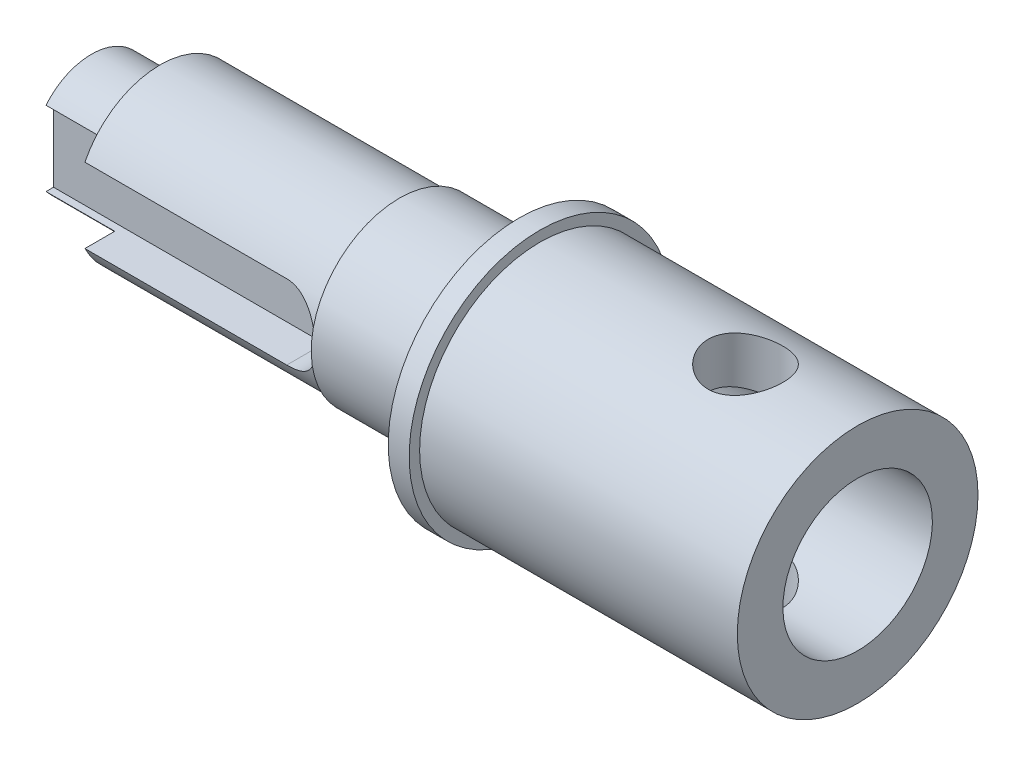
ISO-10303-21;
HEADER;
FILE_DESCRIPTION(('STEP AP214'),'2;1');
FILE_NAME('part.step','',(''),(''),'','','');
FILE_SCHEMA(('AUTOMOTIVE_DESIGN { 1 0 10303 214 1 1 1 1 }'));
ENDSEC;
DATA;
#1=APPLICATION_CONTEXT('core data for automotive mechanical design processes');
#2=APPLICATION_PROTOCOL_DEFINITION('international standard','automotive_design',2000,#1);
#3=PRODUCT_CONTEXT('',#1,'mechanical');
#4=PRODUCT('Part','Part','',(#3));
#5=PRODUCT_RELATED_PRODUCT_CATEGORY('part','',(#4));
#6=PRODUCT_DEFINITION_FORMATION('','',#4);
#7=PRODUCT_DEFINITION_CONTEXT('part definition',#1,'design');
#8=PRODUCT_DEFINITION('design','',#6,#7);
#9=PRODUCT_DEFINITION_SHAPE('','',#8);
#10=(LENGTH_UNIT() NAMED_UNIT(*) SI_UNIT(.MILLI.,.METRE.));
#11=(NAMED_UNIT(*) PLANE_ANGLE_UNIT() SI_UNIT($,.RADIAN.));
#12=(NAMED_UNIT(*) SI_UNIT($,.STERADIAN.) SOLID_ANGLE_UNIT());
#13=UNCERTAINTY_MEASURE_WITH_UNIT(LENGTH_MEASURE(1.E-05),#10,'distance_accuracy_value','');
#14=(GEOMETRIC_REPRESENTATION_CONTEXT(3) GLOBAL_UNCERTAINTY_ASSIGNED_CONTEXT((#13)) GLOBAL_UNIT_ASSIGNED_CONTEXT((#10,
#11,#12)) REPRESENTATION_CONTEXT('',''));
#15=CARTESIAN_POINT('',(0.,0.,0.));
#16=DIRECTION('',(0.,0.,1.));
#17=DIRECTION('',(1.,0.,0.));
#18=AXIS2_PLACEMENT_3D('',#15,#16,#17);
#19=CARTESIAN_POINT('',(65.0875,0.,0.));
#20=DIRECTION('',(1.,0.,0.));
#21=DIRECTION('',(0.,1.,0.));
#22=AXIS2_PLACEMENT_3D('',#19,#20,#21);
#23=CYLINDRICAL_SURFACE('',#22,11.1125);
#24=CARTESIAN_POINT('',(36.322,0.,0.));
#25=DIRECTION('',(1.,0.,0.));
#26=DIRECTION('',(0.,1.,0.));
#27=AXIS2_PLACEMENT_3D('',#24,#25,#26);
#28=CIRCLE('',#27,11.1125);
#29=CARTESIAN_POINT('',(36.322,11.1125,0.));
#30=VERTEX_POINT('',#29);
#31=EDGE_CURVE('E209',#30,#30,#28,.T.);
#32=ORIENTED_EDGE('',*,*,#31,.T.);
#33=EDGE_LOOP('',(#32));
#34=FACE_BOUND('',#33,.T.);
#35=CARTESIAN_POINT('',(38.1,0.,0.));
#36=DIRECTION('',(1.,0.,0.));
#37=DIRECTION('',(0.,1.,0.));
#38=AXIS2_PLACEMENT_3D('',#35,#36,#37);
#39=CIRCLE('',#38,11.1125);
#40=CARTESIAN_POINT('',(38.1,11.1125,0.));
#41=VERTEX_POINT('',#40);
#42=EDGE_CURVE('E281',#41,#41,#39,.F.);
#43=ORIENTED_EDGE('',*,*,#42,.T.);
#44=EDGE_LOOP('',(#43));
#45=FACE_BOUND('',#44,.T.);
#46=ADVANCED_FACE('F39',(#34,#45),#23,.T.);
#47=CARTESIAN_POINT('',(65.0875,0.,0.));
#48=DIRECTION('',(1.,0.,0.));
#49=DIRECTION('',(0.,1.,0.));
#50=AXIS2_PLACEMENT_3D('',#47,#48,#49);
#51=CYLINDRICAL_SURFACE('',#50,4.99999999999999);
#52=DIRECTION('',(1.,0.,0.));
#53=VECTOR('',#52,1.);
#54=CARTESIAN_POINT('',(65.0875,3.175,-3.86256067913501));
#55=LINE('',#54,#53);
#56=CARTESIAN_POINT('',(0.,3.175,-3.86256067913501));
#57=VERTEX_POINT('',#56);
#58=CARTESIAN_POINT('',(5.842,3.175,-3.86256067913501));
#59=VERTEX_POINT('',#58);
#60=EDGE_CURVE('E180',#57,#59,#55,.T.);
#61=ORIENTED_EDGE('',*,*,#60,.F.);
#62=CARTESIAN_POINT('',(0.,0.,0.));
#63=DIRECTION('',(1.,0.,0.));
#64=DIRECTION('',(0.,1.,0.));
#65=AXIS2_PLACEMENT_3D('',#62,#63,#64);
#66=CIRCLE('',#65,4.99999999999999);
#67=CARTESIAN_POINT('',(0.,3.175,3.86256067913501));
#68=VERTEX_POINT('',#67);
#69=EDGE_CURVE('E230',#57,#68,#66,.T.);
#70=ORIENTED_EDGE('',*,*,#69,.T.);
#71=DIRECTION('',(1.,0.,0.));
#72=VECTOR('',#71,1.);
#73=CARTESIAN_POINT('',(65.0875,3.175,3.86256067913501));
#74=LINE('',#73,#72);
#75=CARTESIAN_POINT('',(5.842,3.175,3.86256067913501));
#76=VERTEX_POINT('',#75);
#77=EDGE_CURVE('E199',#76,#68,#74,.F.);
#78=ORIENTED_EDGE('',*,*,#77,.F.);
#79=CARTESIAN_POINT('',(5.842,0.,0.));
#80=DIRECTION('',(1.,0.,0.));
#81=DIRECTION('',(0.,1.,0.));
#82=AXIS2_PLACEMENT_3D('',#79,#80,#81);
#83=CIRCLE('',#82,4.99999999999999);
#84=EDGE_CURVE('E226',#59,#76,#83,.T.);
#85=ORIENTED_EDGE('',*,*,#84,.F.);
#86=EDGE_LOOP('',(#61,#70,#78,#85));
#87=FACE_BOUND('',#86,.T.);
#88=ADVANCED_FACE('F307',(#87),#51,.T.);
#89=CARTESIAN_POINT('',(5.842,4.99999999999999,0.));
#90=DIRECTION('',(-1.,0.,0.));
#91=DIRECTION('',(0.,-1.,0.));
#92=AXIS2_PLACEMENT_3D('',#89,#90,#91);
#93=PLANE('',#92);
#94=DIRECTION('',(0.,0.,-1.));
#95=VECTOR('',#94,1.);
#96=CARTESIAN_POINT('',(5.842,3.175,0.));
#97=LINE('',#96,#95);
#98=CARTESIAN_POINT('',(5.842,3.175,-6.39941708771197));
#99=VERTEX_POINT('',#98);
#100=EDGE_CURVE('E178',#59,#99,#97,.T.);
#101=ORIENTED_EDGE('',*,*,#100,.F.);
#102=ORIENTED_EDGE('',*,*,#84,.T.);
#103=DIRECTION('',(0.,0.,-1.));
#104=VECTOR('',#103,1.);
#105=CARTESIAN_POINT('',(5.842,3.175,0.));
#106=LINE('',#105,#104);
#107=CARTESIAN_POINT('',(5.842,3.175,6.39941708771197));
#108=VERTEX_POINT('',#107);
#109=EDGE_CURVE('E196',#108,#76,#106,.T.);
#110=ORIENTED_EDGE('',*,*,#109,.F.);
#111=CARTESIAN_POINT('',(5.842,0.,0.));
#112=DIRECTION('',(1.,0.,0.));
#113=DIRECTION('',(0.,1.,0.));
#114=AXIS2_PLACEMENT_3D('',#111,#112,#113);
#115=CIRCLE('',#114,7.14374999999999);
#116=EDGE_CURVE('E222',#99,#108,#115,.T.);
#117=ORIENTED_EDGE('',*,*,#116,.F.);
#118=EDGE_LOOP('',(#101,#102,#110,#117));
#119=FACE_BOUND('',#118,.T.);
#120=ADVANCED_FACE('F313',(#119),#93,.T.);
#121=CARTESIAN_POINT('',(65.0875,0.,0.));
#122=DIRECTION('',(1.,0.,0.));
#123=DIRECTION('',(0.,1.,0.));
#124=AXIS2_PLACEMENT_3D('',#121,#122,#123);
#125=CYLINDRICAL_SURFACE('',#124,7.14374999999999);
#126=DIRECTION('',(1.,0.,0.));
#127=VECTOR('',#126,1.);
#128=CARTESIAN_POINT('',(65.0875,3.175,-6.39941708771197));
#129=LINE('',#128,#127);
#130=CARTESIAN_POINT('',(22.987,3.175,-6.39941708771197));
#131=VERTEX_POINT('',#130);
#132=EDGE_CURVE('E176',#99,#131,#129,.T.);
#133=ORIENTED_EDGE('',*,*,#132,.F.);
#134=ORIENTED_EDGE('',*,*,#116,.T.);
#135=DIRECTION('',(1.,0.,0.));
#136=VECTOR('',#135,1.);
#137=CARTESIAN_POINT('',(65.0875,3.175,6.39941708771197));
#138=LINE('',#137,#136);
#139=CARTESIAN_POINT('',(22.987,3.175,6.39941708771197));
#140=VERTEX_POINT('',#139);
#141=EDGE_CURVE('E193',#140,#108,#138,.F.);
#142=ORIENTED_EDGE('',*,*,#141,.F.);
#143=CARTESIAN_POINT('',(22.987,3.175,6.39941708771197));
#144=CARTESIAN_POINT('',(23.0714822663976,3.17501363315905,6.3993967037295));
#145=CARTESIAN_POINT('',(23.1559533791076,3.17162848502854,6.40108952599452));
#146=CARTESIAN_POINT('',(23.324192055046,3.15816746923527,6.40774880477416));
#147=CARTESIAN_POINT('',(23.4079599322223,3.14809476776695,6.41271371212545));
#148=CARTESIAN_POINT('',(23.5737964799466,3.12142890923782,6.42573359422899));
#149=CARTESIAN_POINT('',(23.6558713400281,3.10486701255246,6.43377375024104));
#150=CARTESIAN_POINT('',(23.8181401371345,3.06542192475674,6.45266061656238));
#151=CARTESIAN_POINT('',(23.8983339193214,3.04253821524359,6.46350755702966));
#152=CARTESIAN_POINT('',(24.1350594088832,2.96480782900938,6.49972087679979));
#153=CARTESIAN_POINT('',(24.2881305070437,2.90081719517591,6.52879340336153));
#154=CARTESIAN_POINT('',(24.5814591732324,2.75055968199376,6.5935004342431));
#155=CARTESIAN_POINT('',(24.7217005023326,2.66426508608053,6.62914308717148));
#156=CARTESIAN_POINT('',(24.9952001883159,2.46538412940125,6.70575084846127));
#157=CARTESIAN_POINT('',(25.1274416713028,2.35147129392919,6.74691046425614));
#158=CARTESIAN_POINT('',(25.3716887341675,2.10337941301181,6.82832291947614));
#159=CARTESIAN_POINT('',(25.4836891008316,1.96919516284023,6.86857552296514));
#160=CARTESIAN_POINT('',(25.6898611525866,1.6759735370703,6.94610708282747));
#161=CARTESIAN_POINT('',(25.7828305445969,1.51601701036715,6.98312927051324));
#162=CARTESIAN_POINT('',(25.940014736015,1.18088456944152,7.04752924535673));
#163=CARTESIAN_POINT('',(26.0042668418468,1.00572875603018,7.0749195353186));
#164=CARTESIAN_POINT('',(26.0888112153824,0.691819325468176,7.1114516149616));
#165=CARTESIAN_POINT('',(26.1161574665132,0.555279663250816,7.12347420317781));
#166=CARTESIAN_POINT('',(26.143608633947,0.348296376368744,7.13559074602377));
#167=CARTESIAN_POINT('',(26.1504977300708,0.278872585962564,7.13864344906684));
#168=CARTESIAN_POINT('',(26.1596957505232,0.139639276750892,7.14272567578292));
#169=CARTESIAN_POINT('',(26.16200309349,0.0698296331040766,7.14375450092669));
#170=CARTESIAN_POINT('',(26.162,0.,7.14374999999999));
#171=B_SPLINE_CURVE_WITH_KNOTS('',3,(#143,#144,#145,#146,#147,#148,#149,#150,#151,#152,#153,
#154,#155,#156,#157,#158,#159,#160,#161,#162,#163,#164,#165,#166,#167,#168,#169,#170),
.UNSPECIFIED.,.F.,.F.,(4,2,2,2,2,2,2,2,2,2,2,2,2,4),(0.,0.253343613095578,0.506567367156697,
0.758585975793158,1.01062525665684,1.51351322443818,2.01702914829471,2.55267983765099,
3.08846829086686,3.65161340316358,4.21402479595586,4.6318917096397,4.84122371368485,
5.05062795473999),.UNSPECIFIED.);
#172=CARTESIAN_POINT('',(26.162,0.,7.14374999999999));
#173=VERTEX_POINT('',#172);
#174=EDGE_CURVE('E351',#140,#173,#171,.T.);
#175=ORIENTED_EDGE('',*,*,#174,.T.);
#176=CARTESIAN_POINT('',(26.162,0.,0.));
#177=DIRECTION('',(1.,0.,0.));
#178=DIRECTION('',(0.,1.,0.));
#179=AXIS2_PLACEMENT_3D('',#176,#177,#178);
#180=CIRCLE('',#179,7.14374999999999);
#181=CARTESIAN_POINT('',(26.162,0.,-7.14374999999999));
#182=VERTEX_POINT('',#181);
#183=EDGE_CURVE('E218',#182,#173,#180,.T.);
#184=ORIENTED_EDGE('',*,*,#183,.F.);
#185=CARTESIAN_POINT('',(26.162,0.,-7.14374999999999));
#186=CARTESIAN_POINT('',(26.1620126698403,0.0849008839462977,-7.14376379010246));
#187=CARTESIAN_POINT('',(26.1585948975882,0.169793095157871,-7.14223682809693));
#188=CARTESIAN_POINT('',(26.1449968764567,0.33889933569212,-7.13620455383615));
#189=CARTESIAN_POINT('',(26.1348189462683,0.42311358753,-7.13170026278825));
#190=CARTESIAN_POINT('',(26.1078527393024,0.589929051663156,-7.11984003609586));
#191=CARTESIAN_POINT('',(26.0910909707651,0.672535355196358,-7.11249553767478));
#192=CARTESIAN_POINT('',(26.051149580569,0.835877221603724,-7.09515549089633));
#193=CARTESIAN_POINT('',(26.0279696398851,0.916612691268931,-7.08515981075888));
#194=CARTESIAN_POINT('',(25.949167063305,1.15504599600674,-7.05157264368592));
#195=CARTESIAN_POINT('',(25.8842322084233,1.30927185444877,-7.02435829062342));
#196=CARTESIAN_POINT('',(25.7317590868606,1.60456313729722,-6.96285808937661));
#197=CARTESIAN_POINT('',(25.6442009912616,1.74561686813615,-6.92856604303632));
#198=CARTESIAN_POINT('',(25.4439192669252,2.01846882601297,-6.85418991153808));
#199=CARTESIAN_POINT('',(25.3301526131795,2.14944644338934,-6.81390143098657));
#200=CARTESIAN_POINT('',(25.0828959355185,2.39118655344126,-6.73288078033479));
#201=CARTESIAN_POINT('',(24.9493946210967,2.50193739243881,-6.69214836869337));
#202=CARTESIAN_POINT('',(24.6570676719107,2.70649985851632,-6.61216963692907));
#203=CARTESIAN_POINT('',(24.4972191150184,2.79894667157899,-6.5731485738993));
#204=CARTESIAN_POINT('',(24.1624116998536,2.95517249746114,-6.50441880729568));
#205=CARTESIAN_POINT('',(23.987478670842,3.0189993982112,-6.47469457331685));
#206=CARTESIAN_POINT('',(23.6746435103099,3.10269252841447,-6.43490456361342));
#207=CARTESIAN_POINT('',(23.539029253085,3.12969161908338,-6.42173002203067));
#208=CARTESIAN_POINT('',(23.3333492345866,3.15681380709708,-6.4084150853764));
#209=CARTESIAN_POINT('',(23.2643222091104,3.1636252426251,-6.4050510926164));
#210=CARTESIAN_POINT('',(23.1258704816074,3.17272099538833,-6.40054817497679));
#211=CARTESIAN_POINT('',(23.0564456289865,3.1750034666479,-6.39941015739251));
#212=CARTESIAN_POINT('',(22.987,3.175,-6.39941708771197));
#213=B_SPLINE_CURVE_WITH_KNOTS('',3,(#185,#186,#187,#188,#189,#190,#191,#192,#193,#194,#195,
#196,#197,#198,#199,#200,#201,#202,#203,#204,#205,#206,#207,#208,#209,#210,#211,#212),
.UNSPECIFIED.,.F.,.F.,(4,2,2,2,2,2,2,2,2,2,2,2,2,4),(0.,0.25460565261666,0.509124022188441,
0.762627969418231,1.01614451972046,1.52227117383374,2.02884295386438,2.560855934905,
3.09317447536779,3.65654195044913,4.21896322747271,4.63421700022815,4.84238207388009,
5.05063197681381),.UNSPECIFIED.);
#214=EDGE_CURVE('E12',#182,#131,#213,.T.);
#215=ORIENTED_EDGE('',*,*,#214,.T.);
#216=EDGE_LOOP('',(#133,#134,#142,#175,#184,#215));
#217=FACE_BOUND('',#216,.T.);
#218=ADVANCED_FACE('F339',(#217),#125,.T.);
#219=CARTESIAN_POINT('',(0.,0.,0.));
#220=DIRECTION('',(-1.,0.,0.));
#221=DIRECTION('',(0.,-1.,0.));
#222=AXIS2_PLACEMENT_3D('',#219,#220,#221);
#223=PLANE('',#222);
#224=DIRECTION('',(0.,0.,-1.));
#225=VECTOR('',#224,1.);
#226=CARTESIAN_POINT('',(0.,3.175,-9.57326));
#227=LINE('',#226,#225);
#228=CARTESIAN_POINT('',(0.,3.175,-3.22326));
#229=VERTEX_POINT('',#228);
#230=EDGE_CURVE('E163',#229,#57,#227,.T.);
#231=ORIENTED_EDGE('',*,*,#230,.F.);
#232=DIRECTION('',(0.,1.,0.));
#233=VECTOR('',#232,1.);
#234=CARTESIAN_POINT('',(0.,3.175,-3.22326));
#235=LINE('',#234,#233);
#236=CARTESIAN_POINT('',(0.,-3.175,-3.22326));
#237=VERTEX_POINT('',#236);
#238=EDGE_CURVE('E148',#237,#229,#235,.T.);
#239=ORIENTED_EDGE('',*,*,#238,.F.);
#240=DIRECTION('',(0.,0.,1.));
#241=VECTOR('',#240,1.);
#242=CARTESIAN_POINT('',(0.,-3.175,-9.57326));
#243=LINE('',#242,#241);
#244=CARTESIAN_POINT('',(0.,-3.175,-3.86256067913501));
#245=VERTEX_POINT('',#244);
#246=EDGE_CURVE('E156',#245,#237,#243,.T.);
#247=ORIENTED_EDGE('',*,*,#246,.F.);
#248=CARTESIAN_POINT('',(0.,-3.175,3.86256067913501));
#249=VERTEX_POINT('',#248);
#250=EDGE_CURVE('E231',#249,#245,#66,.T.);
#251=ORIENTED_EDGE('',*,*,#250,.F.);
#252=DIRECTION('',(0.,0.,1.));
#253=VECTOR('',#252,1.);
#254=CARTESIAN_POINT('',(0.,-3.175,9.57326));
#255=LINE('',#254,#253);
#256=CARTESIAN_POINT('',(0.,-3.175,3.22326));
#257=VERTEX_POINT('',#256);
#258=EDGE_CURVE('E188',#257,#249,#255,.T.);
#259=ORIENTED_EDGE('',*,*,#258,.F.);
#260=DIRECTION('',(0.,-1.,0.));
#261=VECTOR('',#260,1.);
#262=CARTESIAN_POINT('',(0.,3.175,3.22326));
#263=LINE('',#262,#261);
#264=CARTESIAN_POINT('',(0.,3.175,3.22326));
#265=VERTEX_POINT('',#264);
#266=EDGE_CURVE('E185',#265,#257,#263,.T.);
#267=ORIENTED_EDGE('',*,*,#266,.F.);
#268=DIRECTION('',(0.,0.,-1.));
#269=VECTOR('',#268,1.);
#270=CARTESIAN_POINT('',(0.,3.175,9.57326));
#271=LINE('',#270,#269);
#272=EDGE_CURVE('E182',#68,#265,#271,.T.);
#273=ORIENTED_EDGE('',*,*,#272,.F.);
#274=ORIENTED_EDGE('',*,*,#69,.F.);
#275=EDGE_LOOP('',(#231,#239,#247,#251,#259,#267,#273,#274));
#276=FACE_BOUND('',#275,.T.);
#277=ADVANCED_FACE('F165',(#276),#223,.T.);
#278=DIRECTION('',(1.,0.,0.));
#279=VECTOR('',#278,1.);
#280=CARTESIAN_POINT('',(65.0875,-3.175,-3.86256067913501));
#281=LINE('',#280,#279);
#282=CARTESIAN_POINT('',(5.842,-3.175,-3.86256067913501));
#283=VERTEX_POINT('',#282);
#284=EDGE_CURVE('E159',#283,#245,#281,.F.);
#285=ORIENTED_EDGE('',*,*,#284,.F.);
#286=CARTESIAN_POINT('',(5.842,-3.175,3.86256067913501));
#287=VERTEX_POINT('',#286);
#288=EDGE_CURVE('E227',#287,#283,#83,.T.);
#289=ORIENTED_EDGE('',*,*,#288,.F.);
#290=DIRECTION('',(1.,0.,0.));
#291=VECTOR('',#290,1.);
#292=CARTESIAN_POINT('',(65.0875,-3.175,3.86256067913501));
#293=LINE('',#292,#291);
#294=EDGE_CURVE('E207',#249,#287,#293,.T.);
#295=ORIENTED_EDGE('',*,*,#294,.F.);
#296=ORIENTED_EDGE('',*,*,#250,.T.);
#297=EDGE_LOOP('',(#285,#289,#295,#296));
#298=FACE_BOUND('',#297,.T.);
#299=ADVANCED_FACE('F316',(#298),#51,.T.);
#300=DIRECTION('',(0.,0.,1.));
#301=VECTOR('',#300,1.);
#302=CARTESIAN_POINT('',(5.842,-3.175,0.));
#303=LINE('',#302,#301);
#304=CARTESIAN_POINT('',(5.842,-3.175,-6.39941708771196));
#305=VERTEX_POINT('',#304);
#306=EDGE_CURVE('E173',#305,#283,#303,.T.);
#307=ORIENTED_EDGE('',*,*,#306,.F.);
#308=CARTESIAN_POINT('',(5.842,-3.175,6.39941708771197));
#309=VERTEX_POINT('',#308);
#310=EDGE_CURVE('E223',#309,#305,#115,.T.);
#311=ORIENTED_EDGE('',*,*,#310,.F.);
#312=DIRECTION('',(0.,0.,1.));
#313=VECTOR('',#312,1.);
#314=CARTESIAN_POINT('',(5.842,-3.175,0.));
#315=LINE('',#314,#313);
#316=EDGE_CURVE('E205',#287,#309,#315,.T.);
#317=ORIENTED_EDGE('',*,*,#316,.F.);
#318=ORIENTED_EDGE('',*,*,#288,.T.);
#319=EDGE_LOOP('',(#307,#311,#317,#318));
#320=FACE_BOUND('',#319,.T.);
#321=ADVANCED_FACE('F337',(#320),#93,.T.);
#322=DIRECTION('',(1.,0.,0.));
#323=VECTOR('',#322,1.);
#324=CARTESIAN_POINT('',(65.0875,-3.175,-6.39941708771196));
#325=LINE('',#324,#323);
#326=CARTESIAN_POINT('',(22.987,-3.175,-6.39941708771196));
#327=VERTEX_POINT('',#326);
#328=EDGE_CURVE('E170',#327,#305,#325,.F.);
#329=ORIENTED_EDGE('',*,*,#328,.F.);
#330=CARTESIAN_POINT('',(22.987,-3.175,-6.39941708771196));
#331=CARTESIAN_POINT('',(23.0714822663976,-3.17501363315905,-6.3993967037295));
#332=CARTESIAN_POINT('',(23.1559533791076,-3.17162848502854,-6.40108952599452));
#333=CARTESIAN_POINT('',(23.324192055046,-3.15816746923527,-6.40774880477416));
#334=CARTESIAN_POINT('',(23.4079599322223,-3.14809476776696,-6.41271371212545));
#335=CARTESIAN_POINT('',(23.5737964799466,-3.12142890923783,-6.42573359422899));
#336=CARTESIAN_POINT('',(23.6558713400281,-3.10486701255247,-6.43377375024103));
#337=CARTESIAN_POINT('',(23.8181401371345,-3.06542192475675,-6.45266061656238));
#338=CARTESIAN_POINT('',(23.8983339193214,-3.0425382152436,-6.46350755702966));
#339=CARTESIAN_POINT('',(24.1350594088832,-2.96480782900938,-6.49972087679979));
#340=CARTESIAN_POINT('',(24.2881305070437,-2.90081719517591,-6.52879340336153));
#341=CARTESIAN_POINT('',(24.5814591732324,-2.75055968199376,-6.5935004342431));
#342=CARTESIAN_POINT('',(24.7217005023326,-2.66426508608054,-6.62914308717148));
#343=CARTESIAN_POINT('',(24.9952001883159,-2.46538412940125,-6.70575084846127));
#344=CARTESIAN_POINT('',(25.1274416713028,-2.3514712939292,-6.74691046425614));
#345=CARTESIAN_POINT('',(25.3716887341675,-2.10337941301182,-6.82832291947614));
#346=CARTESIAN_POINT('',(25.4836891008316,-1.96919516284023,-6.86857552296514));
#347=CARTESIAN_POINT('',(25.6898611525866,-1.6759735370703,-6.94610708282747));
#348=CARTESIAN_POINT('',(25.7828305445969,-1.51601701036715,-6.98312927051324));
#349=CARTESIAN_POINT('',(25.940014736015,-1.18088456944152,-7.04752924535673));
#350=CARTESIAN_POINT('',(26.0042668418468,-1.00572875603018,-7.0749195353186));
#351=CARTESIAN_POINT('',(26.0888112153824,-0.691819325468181,-7.1114516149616));
#352=CARTESIAN_POINT('',(26.1161574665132,-0.555279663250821,-7.12347420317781));
#353=CARTESIAN_POINT('',(26.143608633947,-0.348296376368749,-7.13559074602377));
#354=CARTESIAN_POINT('',(26.1504977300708,-0.27887258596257,-7.13864344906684));
#355=CARTESIAN_POINT('',(26.1596957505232,-0.139639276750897,-7.14272567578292));
#356=CARTESIAN_POINT('',(26.16200309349,-0.0698296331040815,-7.14375450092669));
#357=CARTESIAN_POINT('',(26.162,0.,-7.14374999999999));
#358=B_SPLINE_CURVE_WITH_KNOTS('',3,(#330,#331,#332,#333,#334,#335,#336,#337,#338,#339,#340,
#341,#342,#343,#344,#345,#346,#347,#348,#349,#350,#351,#352,#353,#354,#355,#356,#357),
.UNSPECIFIED.,.F.,.F.,(4,2,2,2,2,2,2,2,2,2,2,2,2,4),(0.,0.253343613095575,0.506567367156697,
0.758585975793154,1.01062525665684,1.51351322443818,2.01702914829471,2.55267983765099,
3.08846829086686,3.65161340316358,4.21402479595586,4.6318917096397,4.84122371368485,
5.05062795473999),.UNSPECIFIED.);
#359=EDGE_CURVE('E49',#327,#182,#358,.T.);
#360=ORIENTED_EDGE('',*,*,#359,.T.);
#361=EDGE_CURVE('E219',#173,#182,#180,.T.);
#362=ORIENTED_EDGE('',*,*,#361,.F.);
#363=CARTESIAN_POINT('',(26.162,0.,7.14374999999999));
#364=CARTESIAN_POINT('',(26.1620126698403,-0.0849008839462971,7.14376379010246));
#365=CARTESIAN_POINT('',(26.1585948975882,-0.169793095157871,7.14223682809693));
#366=CARTESIAN_POINT('',(26.1449968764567,-0.33889933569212,7.13620455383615));
#367=CARTESIAN_POINT('',(26.1348189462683,-0.42311358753,7.13170026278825));
#368=CARTESIAN_POINT('',(26.1078527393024,-0.589929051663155,7.11984003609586));
#369=CARTESIAN_POINT('',(26.0910909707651,-0.672535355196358,7.11249553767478));
#370=CARTESIAN_POINT('',(26.051149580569,-0.835877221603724,7.09515549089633));
#371=CARTESIAN_POINT('',(26.0279696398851,-0.916612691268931,7.08515981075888));
#372=CARTESIAN_POINT('',(25.949167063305,-1.15504599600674,7.05157264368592));
#373=CARTESIAN_POINT('',(25.8842322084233,-1.30927185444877,7.02435829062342));
#374=CARTESIAN_POINT('',(25.7317590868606,-1.60456313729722,6.96285808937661));
#375=CARTESIAN_POINT('',(25.6442009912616,-1.74561686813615,6.92856604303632));
#376=CARTESIAN_POINT('',(25.4439192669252,-2.01846882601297,6.85418991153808));
#377=CARTESIAN_POINT('',(25.3301526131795,-2.14944644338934,6.81390143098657));
#378=CARTESIAN_POINT('',(25.0828959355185,-2.39118655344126,6.73288078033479));
#379=CARTESIAN_POINT('',(24.9493946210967,-2.50193739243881,6.69214836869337));
#380=CARTESIAN_POINT('',(24.6570676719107,-2.70649985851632,6.61216963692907));
#381=CARTESIAN_POINT('',(24.4972191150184,-2.79894667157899,6.5731485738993));
#382=CARTESIAN_POINT('',(24.1624116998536,-2.95517249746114,6.50441880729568));
#383=CARTESIAN_POINT('',(23.987478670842,-3.0189993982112,6.47469457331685));
#384=CARTESIAN_POINT('',(23.6746435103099,-3.10269252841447,6.43490456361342));
#385=CARTESIAN_POINT('',(23.539029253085,-3.12969161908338,6.42173002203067));
#386=CARTESIAN_POINT('',(23.3333492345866,-3.15681380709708,6.4084150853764));
#387=CARTESIAN_POINT('',(23.2643222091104,-3.1636252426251,6.4050510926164));
#388=CARTESIAN_POINT('',(23.1258704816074,-3.17272099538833,6.40054817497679));
#389=CARTESIAN_POINT('',(23.0564456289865,-3.1750034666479,6.39941015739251));
#390=CARTESIAN_POINT('',(22.987,-3.175,6.39941708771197));
#391=B_SPLINE_CURVE_WITH_KNOTS('',3,(#363,#364,#365,#366,#367,#368,#369,#370,#371,#372,#373,
#374,#375,#376,#377,#378,#379,#380,#381,#382,#383,#384,#385,#386,#387,#388,#389,#390),
.UNSPECIFIED.,.F.,.F.,(4,2,2,2,2,2,2,2,2,2,2,2,2,4),(0.,0.25460565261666,0.509124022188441,
0.762627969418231,1.01614451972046,1.52227117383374,2.02884295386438,2.560855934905,
3.09317447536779,3.65654195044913,4.21896322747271,4.63421700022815,4.84238207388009,
5.05063197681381),.UNSPECIFIED.);
#392=CARTESIAN_POINT('',(22.987,-3.175,6.39941708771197));
#393=VERTEX_POINT('',#392);
#394=EDGE_CURVE('E343',#173,#393,#391,.T.);
#395=ORIENTED_EDGE('',*,*,#394,.T.);
#396=DIRECTION('',(1.,0.,0.));
#397=VECTOR('',#396,1.);
#398=CARTESIAN_POINT('',(65.0875,-3.175,6.39941708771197));
#399=LINE('',#398,#397);
#400=EDGE_CURVE('E202',#309,#393,#399,.T.);
#401=ORIENTED_EDGE('',*,*,#400,.F.);
#402=ORIENTED_EDGE('',*,*,#310,.T.);
#403=EDGE_LOOP('',(#329,#360,#362,#395,#401,#402));
#404=FACE_BOUND('',#403,.T.);
#405=ADVANCED_FACE('F332',(#404),#125,.T.);
#406=CARTESIAN_POINT('',(26.162,7.14374999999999,0.));
#407=DIRECTION('',(-1.,0.,0.));
#408=DIRECTION('',(0.,-1.,0.));
#409=AXIS2_PLACEMENT_3D('',#406,#407,#408);
#410=PLANE('',#409);
#411=CARTESIAN_POINT('',(26.162,0.,0.));
#412=DIRECTION('',(1.,0.,0.));
#413=DIRECTION('',(0.,1.,0.));
#414=AXIS2_PLACEMENT_3D('',#411,#412,#413);
#415=CIRCLE('',#414,7.49299999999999);
#416=CARTESIAN_POINT('',(26.162,7.49299999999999,0.));
#417=VERTEX_POINT('',#416);
#418=EDGE_CURVE('E215',#417,#417,#415,.T.);
#419=ORIENTED_EDGE('',*,*,#418,.F.);
#420=EDGE_LOOP('',(#419));
#421=FACE_BOUND('',#420,.T.);
#422=ORIENTED_EDGE('',*,*,#183,.T.);
#423=ORIENTED_EDGE('',*,*,#361,.T.);
#424=EDGE_LOOP('',(#422,#423));
#425=FACE_BOUND('',#424,.T.);
#426=ADVANCED_FACE('F328',(#421,#425),#410,.T.);
#427=CARTESIAN_POINT('',(65.0875,0.,0.));
#428=DIRECTION('',(1.,0.,0.));
#429=DIRECTION('',(0.,1.,0.));
#430=AXIS2_PLACEMENT_3D('',#427,#428,#429);
#431=CYLINDRICAL_SURFACE('',#430,7.49299999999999);
#432=ORIENTED_EDGE('',*,*,#418,.T.);
#433=EDGE_LOOP('',(#432));
#434=FACE_BOUND('',#433,.T.);
#435=CARTESIAN_POINT('',(36.322,0.,0.));
#436=DIRECTION('',(1.,0.,0.));
#437=DIRECTION('',(0.,1.,0.));
#438=AXIS2_PLACEMENT_3D('',#435,#436,#437);
#439=CIRCLE('',#438,7.49299999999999);
#440=CARTESIAN_POINT('',(36.322,7.49299999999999,0.));
#441=VERTEX_POINT('',#440);
#442=EDGE_CURVE('E212',#441,#441,#439,.T.);
#443=ORIENTED_EDGE('',*,*,#442,.F.);
#444=EDGE_LOOP('',(#443));
#445=FACE_BOUND('',#444,.T.);
#446=ADVANCED_FACE('F324',(#434,#445),#431,.T.);
#447=CARTESIAN_POINT('',(36.322,11.1125,0.));
#448=DIRECTION('',(-1.,0.,0.));
#449=DIRECTION('',(0.,-1.,0.));
#450=AXIS2_PLACEMENT_3D('',#447,#448,#449);
#451=PLANE('',#450);
#452=ORIENTED_EDGE('',*,*,#442,.T.);
#453=EDGE_LOOP('',(#452));
#454=FACE_BOUND('',#453,.T.);
#455=ORIENTED_EDGE('',*,*,#31,.F.);
#456=EDGE_LOOP('',(#455));
#457=FACE_BOUND('',#456,.T.);
#458=ADVANCED_FACE('F320',(#454,#457),#451,.T.);
#459=CARTESIAN_POINT('',(26.162,-3.175,9.57326));
#460=DIRECTION('',(0.,-1.,0.));
#461=DIRECTION('',(1.,0.,0.));
#462=AXIS2_PLACEMENT_3D('',#459,#460,#461);
#463=PLANE('',#462);
#464=ORIENTED_EDGE('',*,*,#400,.T.);
#465=DIRECTION('',(0.,0.,1.));
#466=VECTOR('',#465,1.);
#467=CARTESIAN_POINT('',(22.987,-3.175,9.57326));
#468=LINE('',#467,#466);
#469=CARTESIAN_POINT('',(22.987,-3.175,3.22326));
#470=VERTEX_POINT('',#469);
#471=EDGE_CURVE('E233',#393,#470,#468,.F.);
#472=ORIENTED_EDGE('',*,*,#471,.T.);
#473=DIRECTION('',(-1.,0.,0.));
#474=VECTOR('',#473,1.);
#475=CARTESIAN_POINT('',(26.162,-3.175,3.22326));
#476=LINE('',#475,#474);
#477=EDGE_CURVE('E191',#470,#257,#476,.T.);
#478=ORIENTED_EDGE('',*,*,#477,.T.);
#479=ORIENTED_EDGE('',*,*,#258,.T.);
#480=ORIENTED_EDGE('',*,*,#294,.T.);
#481=ORIENTED_EDGE('',*,*,#316,.T.);
#482=EDGE_LOOP('',(#464,#472,#478,#479,#480,#481));
#483=FACE_BOUND('',#482,.T.);
#484=ADVANCED_FACE('F323',(#483),#463,.F.);
#485=CARTESIAN_POINT('',(26.162,3.175,3.22326));
#486=DIRECTION('',(0.,0.,-1.));
#487=DIRECTION('',(0.,1.,0.));
#488=AXIS2_PLACEMENT_3D('',#485,#486,#487);
#489=PLANE('',#488);
#490=ORIENTED_EDGE('',*,*,#477,.F.);
#491=CARTESIAN_POINT('',(22.987,0.,3.22326));
#492=DIRECTION('',(0.,0.,-1.));
#493=DIRECTION('',(0.,1.,0.));
#494=AXIS2_PLACEMENT_3D('',#491,#492,#493);
#495=CIRCLE('',#494,3.175);
#496=CARTESIAN_POINT('',(26.162,0.,3.22326));
#497=VERTEX_POINT('',#496);
#498=EDGE_CURVE('E405',#470,#497,#495,.F.);
#499=ORIENTED_EDGE('',*,*,#498,.T.);
#500=CARTESIAN_POINT('',(22.987,0.,3.22326));
#501=DIRECTION('',(0.,0.,-1.));
#502=DIRECTION('',(0.,1.,0.));
#503=AXIS2_PLACEMENT_3D('',#500,#501,#502);
#504=CIRCLE('',#503,3.175);
#505=CARTESIAN_POINT('',(22.987,3.175,3.22326));
#506=VERTEX_POINT('',#505);
#507=EDGE_CURVE('E407',#497,#506,#504,.F.);
#508=ORIENTED_EDGE('',*,*,#507,.T.);
#509=DIRECTION('',(-1.,0.,0.));
#510=VECTOR('',#509,1.);
#511=CARTESIAN_POINT('',(26.162,3.175,3.22326));
#512=LINE('',#511,#510);
#513=EDGE_CURVE('E190',#506,#265,#512,.T.);
#514=ORIENTED_EDGE('',*,*,#513,.T.);
#515=ORIENTED_EDGE('',*,*,#266,.T.);
#516=EDGE_LOOP('',(#490,#499,#508,#514,#515));
#517=FACE_BOUND('',#516,.T.);
#518=ADVANCED_FACE('F433',(#517),#489,.F.);
#519=CARTESIAN_POINT('',(26.162,3.175,9.57326));
#520=DIRECTION('',(0.,1.,0.));
#521=DIRECTION('',(0.,0.,1.));
#522=AXIS2_PLACEMENT_3D('',#519,#520,#521);
#523=PLANE('',#522);
#524=ORIENTED_EDGE('',*,*,#513,.F.);
#525=DIRECTION('',(0.,0.,-1.));
#526=VECTOR('',#525,1.);
#527=CARTESIAN_POINT('',(22.987,3.175,9.57326));
#528=LINE('',#527,#526);
#529=EDGE_CURVE('E403',#506,#140,#528,.F.);
#530=ORIENTED_EDGE('',*,*,#529,.T.);
#531=ORIENTED_EDGE('',*,*,#141,.T.);
#532=ORIENTED_EDGE('',*,*,#109,.T.);
#533=ORIENTED_EDGE('',*,*,#77,.T.);
#534=ORIENTED_EDGE('',*,*,#272,.T.);
#535=EDGE_LOOP('',(#524,#530,#531,#532,#533,#534));
#536=FACE_BOUND('',#535,.T.);
#537=ADVANCED_FACE('F427',(#536),#523,.F.);
#538=CARTESIAN_POINT('',(26.162,3.175,-9.57326));
#539=DIRECTION('',(0.,1.,0.));
#540=DIRECTION('',(0.,0.,1.));
#541=AXIS2_PLACEMENT_3D('',#538,#539,#540);
#542=PLANE('',#541);
#543=ORIENTED_EDGE('',*,*,#132,.T.);
#544=DIRECTION('',(0.,0.,-1.));
#545=VECTOR('',#544,1.);
#546=CARTESIAN_POINT('',(22.987,3.175,-9.57326));
#547=LINE('',#546,#545);
#548=CARTESIAN_POINT('',(22.987,3.175,-3.22326));
#549=VERTEX_POINT('',#548);
#550=EDGE_CURVE('E395',#131,#549,#547,.F.);
#551=ORIENTED_EDGE('',*,*,#550,.T.);
#552=DIRECTION('',(-1.,0.,0.));
#553=VECTOR('',#552,1.);
#554=CARTESIAN_POINT('',(26.162,3.175,-3.22326));
#555=LINE('',#554,#553);
#556=EDGE_CURVE('E153',#549,#229,#555,.T.);
#557=ORIENTED_EDGE('',*,*,#556,.T.);
#558=ORIENTED_EDGE('',*,*,#230,.T.);
#559=ORIENTED_EDGE('',*,*,#60,.T.);
#560=ORIENTED_EDGE('',*,*,#100,.T.);
#561=EDGE_LOOP('',(#543,#551,#557,#558,#559,#560));
#562=FACE_BOUND('',#561,.T.);
#563=ADVANCED_FACE('F425',(#562),#542,.F.);
#564=CARTESIAN_POINT('',(26.162,3.175,-3.22326));
#565=DIRECTION('',(0.,0.,1.));
#566=DIRECTION('',(0.,-1.,0.));
#567=AXIS2_PLACEMENT_3D('',#564,#565,#566);
#568=PLANE('',#567);
#569=CARTESIAN_POINT('',(22.987,0.,-3.22326));
#570=DIRECTION('',(0.,0.,1.));
#571=DIRECTION('',(0.,-1.,0.));
#572=AXIS2_PLACEMENT_3D('',#569,#570,#571);
#573=CIRCLE('',#572,3.175);
#574=CARTESIAN_POINT('',(26.162,0.,-3.22326));
#575=VERTEX_POINT('',#574);
#576=EDGE_CURVE('E401',#549,#575,#573,.F.);
#577=ORIENTED_EDGE('',*,*,#576,.T.);
#578=CARTESIAN_POINT('',(22.987,0.,-3.22326));
#579=DIRECTION('',(0.,0.,1.));
#580=DIRECTION('',(0.,-1.,0.));
#581=AXIS2_PLACEMENT_3D('',#578,#579,#580);
#582=CIRCLE('',#581,3.175);
#583=CARTESIAN_POINT('',(22.987,-3.175,-3.22326));
#584=VERTEX_POINT('',#583);
#585=EDGE_CURVE('E151',#575,#584,#582,.F.);
#586=ORIENTED_EDGE('',*,*,#585,.T.);
#587=DIRECTION('',(-1.,0.,0.));
#588=VECTOR('',#587,1.);
#589=CARTESIAN_POINT('',(26.162,-3.175,-3.22326));
#590=LINE('',#589,#588);
#591=EDGE_CURVE('E143',#584,#237,#590,.T.);
#592=ORIENTED_EDGE('',*,*,#591,.T.);
#593=ORIENTED_EDGE('',*,*,#238,.T.);
#594=ORIENTED_EDGE('',*,*,#556,.F.);
#595=EDGE_LOOP('',(#577,#586,#592,#593,#594));
#596=FACE_BOUND('',#595,.T.);
#597=ADVANCED_FACE('F145',(#596),#568,.F.);
#598=CARTESIAN_POINT('',(26.162,-3.17500000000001,-9.57326));
#599=DIRECTION('',(0.,-1.,0.));
#600=DIRECTION('',(0.,0.,-1.));
#601=AXIS2_PLACEMENT_3D('',#598,#599,#600);
#602=PLANE('',#601);
#603=ORIENTED_EDGE('',*,*,#591,.F.);
#604=DIRECTION('',(0.,0.,1.));
#605=VECTOR('',#604,1.);
#606=CARTESIAN_POINT('',(22.987,-3.17500000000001,-9.57326));
#607=LINE('',#606,#605);
#608=EDGE_CURVE('E396',#584,#327,#607,.F.);
#609=ORIENTED_EDGE('',*,*,#608,.T.);
#610=ORIENTED_EDGE('',*,*,#328,.T.);
#611=ORIENTED_EDGE('',*,*,#306,.T.);
#612=ORIENTED_EDGE('',*,*,#284,.T.);
#613=ORIENTED_EDGE('',*,*,#246,.T.);
#614=EDGE_LOOP('',(#603,#609,#610,#611,#612,#613));
#615=FACE_BOUND('',#614,.T.);
#616=ADVANCED_FACE('F157',(#615),#602,.F.);
#617=CARTESIAN_POINT('',(38.1,0.,0.));
#618=DIRECTION('',(1.,0.,0.));
#619=DIRECTION('',(0.,1.,0.));
#620=AXIS2_PLACEMENT_3D('',#617,#618,#619);
#621=CYLINDRICAL_SURFACE('',#620,10.2235);
#622=CARTESIAN_POINT('',(55.5625,9.71798987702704,3.175));
#623=CARTESIAN_POINT('',(55.3888389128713,9.71799107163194,3.17499866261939));
#624=CARTESIAN_POINT('',(55.2151643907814,9.72269581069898,3.16070365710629));
#625=CARTESIAN_POINT('',(54.872913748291,9.74092450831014,3.10406234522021));
#626=CARTESIAN_POINT('',(54.7043390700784,9.75445093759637,3.06170818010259));
#627=CARTESIAN_POINT('',(54.3772945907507,9.7886464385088,2.95054215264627));
#628=CARTESIAN_POINT('',(54.2188076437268,9.80930298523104,2.88177666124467));
#629=CARTESIAN_POINT('',(53.9155767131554,9.85541391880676,2.719894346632));
#630=CARTESIAN_POINT('',(53.7708351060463,9.88086913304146,2.62677332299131));
#631=CARTESIAN_POINT('',(53.4942932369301,9.93467778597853,2.41544032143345));
#632=CARTESIAN_POINT('',(53.3630279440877,9.96309628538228,2.29654470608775));
#633=CARTESIAN_POINT('',(53.1219417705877,10.0190755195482,2.03850073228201));
#634=CARTESIAN_POINT('',(53.012123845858,10.0466361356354,1.89934958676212));
#635=CARTESIAN_POINT('',(52.8146949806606,10.0985376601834,1.60090629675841));
#636=CARTESIAN_POINT('',(52.7276341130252,10.1227930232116,1.44123408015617));
#637=CARTESIAN_POINT('',(52.5818107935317,10.1645919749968,1.10863238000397));
#638=CARTESIAN_POINT('',(52.5230417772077,10.1821371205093,0.935705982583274));
#639=CARTESIAN_POINT('',(52.4372541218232,10.2080782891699,0.587105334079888));
#640=CARTESIAN_POINT('',(52.4093213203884,10.216737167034,0.41167596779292));
#641=CARTESIAN_POINT('',(52.3831034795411,10.2248581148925,0.0584211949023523));
#642=CARTESIAN_POINT('',(52.3848117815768,10.2243222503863,-0.11940366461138));
#643=CARTESIAN_POINT('',(52.4172243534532,10.2142975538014,-0.465970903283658));
#644=CARTESIAN_POINT('',(52.4469377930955,10.2051146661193,-0.634816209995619));
#645=CARTESIAN_POINT('',(52.5328925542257,10.1792033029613,-0.964993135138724));
#646=CARTESIAN_POINT('',(52.589135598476,10.1624743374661,-1.12632426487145));
#647=CARTESIAN_POINT('',(52.7271950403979,10.1229378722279,-1.43919024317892));
#648=CARTESIAN_POINT('',(52.8093138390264,10.1000589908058,-1.59058225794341));
#649=CARTESIAN_POINT('',(52.9965516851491,10.0506358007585,-1.87774708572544));
#650=CARTESIAN_POINT('',(53.1016764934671,10.0240905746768,-2.01351597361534));
#651=CARTESIAN_POINT('',(53.3370374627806,9.96887235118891,-2.27148954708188));
#652=CARTESIAN_POINT('',(53.4681294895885,9.94015674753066,-2.39290534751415));
#653=CARTESIAN_POINT('',(53.7490844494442,9.88477959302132,-2.61226279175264));
#654=CARTESIAN_POINT('',(53.8989495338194,9.85811827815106,-2.71020174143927));
#655=CARTESIAN_POINT('',(54.2154013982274,9.80965523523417,-2.88072803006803));
#656=CARTESIAN_POINT('',(54.3821529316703,9.78790976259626,-2.95302680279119));
#657=CARTESIAN_POINT('',(54.7263010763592,9.75240156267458,-3.06827224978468));
#658=CARTESIAN_POINT('',(54.9036938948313,9.73863600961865,-3.11122931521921));
#659=CARTESIAN_POINT('',(55.2565388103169,9.72127236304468,-3.1650574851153));
#660=CARTESIAN_POINT('',(55.4317881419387,9.7172921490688,-3.17713522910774));
#661=CARTESIAN_POINT('',(55.7818203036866,9.7188895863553,-3.17224651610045));
#662=CARTESIAN_POINT('',(55.9566032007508,9.72446578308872,-3.15528447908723));
#663=CARTESIAN_POINT('',(56.295571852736,9.74417083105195,-3.09387547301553));
#664=CARTESIAN_POINT('',(56.4599176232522,9.75805189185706,-3.0502240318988));
#665=CARTESIAN_POINT('',(56.7789351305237,9.79254100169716,-2.93760750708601));
#666=CARTESIAN_POINT('',(56.9336052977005,9.81315013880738,-2.86863832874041));
#667=CARTESIAN_POINT('',(57.2337405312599,9.85949986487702,-2.70510860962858));
#668=CARTESIAN_POINT('',(57.3788195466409,9.88536953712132,-2.60987705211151));
#669=CARTESIAN_POINT('',(57.6513775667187,9.93905664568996,-2.39731133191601));
#670=CARTESIAN_POINT('',(57.7788520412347,9.96687458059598,-2.27997149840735));
#671=CARTESIAN_POINT('',(58.0179537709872,10.0226990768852,-2.02081673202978));
#672=CARTESIAN_POINT('',(58.1287208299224,10.0506669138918,-1.87819773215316));
#673=CARTESIAN_POINT('',(58.3247819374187,10.1025028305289,-1.57572152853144));
#674=CARTESIAN_POINT('',(58.4100771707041,10.1263711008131,-1.41586512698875));
#675=CARTESIAN_POINT('',(58.5519537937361,10.167180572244,-1.08444915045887));
#676=CARTESIAN_POINT('',(58.6087443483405,10.1841720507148,-0.912985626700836));
#677=CARTESIAN_POINT('',(58.6924979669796,10.2095347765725,-0.562321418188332));
#678=CARTESIAN_POINT('',(58.719470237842,10.2179086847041,-0.383123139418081));
#679=CARTESIAN_POINT('',(58.7420812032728,10.2249187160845,-0.0299992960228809));
#680=CARTESIAN_POINT('',(58.7389631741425,10.2239412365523,0.143839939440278));
#681=CARTESIAN_POINT('',(58.7044831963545,10.2132815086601,0.488406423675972));
#682=CARTESIAN_POINT('',(58.673123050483,10.2035998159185,0.659133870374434));
#683=CARTESIAN_POINT('',(58.5838373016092,10.1767398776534,0.990583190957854));
#684=CARTESIAN_POINT('',(58.5262410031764,10.1596546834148,1.15140183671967));
#685=CARTESIAN_POINT('',(58.3864148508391,10.1197503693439,1.46117155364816));
#686=CARTESIAN_POINT('',(58.3041807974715,10.0969302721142,1.61012059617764));
#687=CARTESIAN_POINT('',(58.1142142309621,10.0469852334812,1.89737160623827));
#688=CARTESIAN_POINT('',(58.0057173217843,10.0197413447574,2.03514717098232));
#689=CARTESIAN_POINT('',(57.7676574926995,9.96436977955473,2.29094940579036));
#690=CARTESIAN_POINT('',(57.6380883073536,9.93624184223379,2.40897018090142));
#691=CARTESIAN_POINT('',(57.3564979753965,9.88119970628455,2.62579237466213));
#692=CARTESIAN_POINT('',(57.2038825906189,9.85435496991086,2.72384180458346));
#693=CARTESIAN_POINT('',(56.8835367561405,9.80609358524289,2.89279167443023));
#694=CARTESIAN_POINT('',(56.7158126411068,9.78467467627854,2.96370342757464));
#695=CARTESIAN_POINT('',(56.385335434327,9.75150296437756,3.07099605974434));
#696=CARTESIAN_POINT('',(56.2234635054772,9.73906070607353,3.1098841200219));
#697=CARTESIAN_POINT('',(55.8952311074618,9.72230456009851,3.16188365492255));
#698=CARTESIAN_POINT('',(55.7288717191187,9.71798873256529,3.17500128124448));
#699=CARTESIAN_POINT('',(55.5625,9.71798987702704,3.175));
#700=B_SPLINE_CURVE_WITH_KNOTS('',3,(#622,#623,#624,#625,#626,#627,#628,#629,#630,#631,#632,
#633,#634,#635,#636,#637,#638,#639,#640,#641,#642,#643,#644,#645,#646,#647,#648,#649,#650,#651,
#652,#653,#654,#655,#656,#657,#658,#659,#660,#661,#662,#663,#664,#665,#666,#667,#668,#669,#670,
#671,#672,#673,#674,#675,#676,#677,#678,#679,#680,#681,#682,#683,#684,#685,#686,#687,#688,#689,
#690,#691,#692,#693,#694,#695,#696,#697,#698,#699),.UNSPECIFIED.,.T.,.F.,(4,2,2,2,2,2,2,2,2,2,2,
2,2,2,2,2,2,2,2,2,2,2,2,2,2,2,2,2,2,2,2,2,2,2,2,2,2,2,4),(0.,0.520368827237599,1.04088345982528,
1.56048836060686,2.08018293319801,2.61586193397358,3.15161471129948,3.69931963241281,
4.24689741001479,4.77776539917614,5.30851413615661,5.82116285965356,6.33384487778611,
6.85275571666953,7.37179664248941,7.91221325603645,8.45269185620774,8.99907342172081,
9.5452613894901,10.0697555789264,10.5941699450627,11.1036674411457,11.6132473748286,
12.1372958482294,12.6614789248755,13.207077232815,13.7526501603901,14.2941589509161,
14.8355004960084,15.3545737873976,15.8736139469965,16.3863115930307,16.8990966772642,
17.4291238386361,17.9593088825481,18.5067781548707,19.054018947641,19.552664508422,
20.0511910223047),.UNSPECIFIED.);
#701=CARTESIAN_POINT('',(55.5625,9.71798987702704,3.175));
#702=VERTEX_POINT('',#701);
#703=EDGE_CURVE('E270',#702,#702,#700,.T.);
#704=ORIENTED_EDGE('',*,*,#703,.T.);
#705=EDGE_LOOP('',(#704));
#706=FACE_BOUND('',#705,.T.);
#707=CARTESIAN_POINT('',(38.1,0.,0.));
#708=DIRECTION('',(1.,0.,0.));
#709=DIRECTION('',(0.,1.,0.));
#710=AXIS2_PLACEMENT_3D('',#707,#708,#709);
#711=CIRCLE('',#710,10.2235);
#712=CARTESIAN_POINT('',(38.1,10.2235,0.));
#713=VERTEX_POINT('',#712);
#714=EDGE_CURVE('E414',#713,#713,#711,.T.);
#715=ORIENTED_EDGE('',*,*,#714,.T.);
#716=EDGE_LOOP('',(#715));
#717=FACE_BOUND('',#716,.T.);
#718=CARTESIAN_POINT('',(65.0875,0.,0.));
#719=DIRECTION('',(1.,0.,0.));
#720=DIRECTION('',(0.,1.,0.));
#721=AXIS2_PLACEMENT_3D('',#718,#719,#720);
#722=CIRCLE('',#721,10.2235);
#723=CARTESIAN_POINT('',(65.0875,10.2235,0.));
#724=VERTEX_POINT('',#723);
#725=EDGE_CURVE('E282',#724,#724,#722,.T.);
#726=ORIENTED_EDGE('',*,*,#725,.F.);
#727=EDGE_LOOP('',(#726));
#728=FACE_BOUND('',#727,.T.);
#729=CARTESIAN_POINT('',(55.5625,-9.71798987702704,3.175));
#730=CARTESIAN_POINT('',(55.7361610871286,-9.71799107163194,3.17499866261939));
#731=CARTESIAN_POINT('',(55.9098356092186,-9.72269581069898,3.16070365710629));
#732=CARTESIAN_POINT('',(56.252086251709,-9.74092450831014,3.10406234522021));
#733=CARTESIAN_POINT('',(56.4206609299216,-9.75445093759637,3.06170818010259));
#734=CARTESIAN_POINT('',(56.7477054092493,-9.7886464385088,2.95054215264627));
#735=CARTESIAN_POINT('',(56.9061923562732,-9.80930298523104,2.88177666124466));
#736=CARTESIAN_POINT('',(57.2094232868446,-9.85541391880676,2.719894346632));
#737=CARTESIAN_POINT('',(57.3541648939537,-9.88086913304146,2.62677332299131));
#738=CARTESIAN_POINT('',(57.6307067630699,-9.93467778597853,2.41544032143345));
#739=CARTESIAN_POINT('',(57.7619720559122,-9.96309628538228,2.29654470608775));
#740=CARTESIAN_POINT('',(58.0030582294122,-10.0190755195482,2.03850073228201));
#741=CARTESIAN_POINT('',(58.112876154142,-10.0466361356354,1.89934958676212));
#742=CARTESIAN_POINT('',(58.3103050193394,-10.0985376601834,1.60090629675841));
#743=CARTESIAN_POINT('',(58.3973658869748,-10.1227930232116,1.44123408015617));
#744=CARTESIAN_POINT('',(58.5431892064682,-10.1645919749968,1.10863238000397));
#745=CARTESIAN_POINT('',(58.6019582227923,-10.1821371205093,0.935705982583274));
#746=CARTESIAN_POINT('',(58.6877458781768,-10.2080782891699,0.587105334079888));
#747=CARTESIAN_POINT('',(58.7156786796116,-10.216737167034,0.41167596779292));
#748=CARTESIAN_POINT('',(58.7418965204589,-10.2248581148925,0.0584211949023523));
#749=CARTESIAN_POINT('',(58.7401882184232,-10.2243222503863,-0.11940366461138));
#750=CARTESIAN_POINT('',(58.7077756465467,-10.2142975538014,-0.465970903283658));
#751=CARTESIAN_POINT('',(58.6780622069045,-10.2051146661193,-0.634816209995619));
#752=CARTESIAN_POINT('',(58.5921074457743,-10.1792033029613,-0.964993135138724));
#753=CARTESIAN_POINT('',(58.535864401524,-10.1624743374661,-1.12632426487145));
#754=CARTESIAN_POINT('',(58.3978049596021,-10.1229378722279,-1.43919024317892));
#755=CARTESIAN_POINT('',(58.3156861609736,-10.1000589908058,-1.59058225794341));
#756=CARTESIAN_POINT('',(58.1284483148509,-10.0506358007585,-1.87774708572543));
#757=CARTESIAN_POINT('',(58.0233235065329,-10.0240905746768,-2.01351597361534));
#758=CARTESIAN_POINT('',(57.7879625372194,-9.96887235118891,-2.27148954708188));
#759=CARTESIAN_POINT('',(57.6568705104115,-9.94015674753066,-2.39290534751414));
#760=CARTESIAN_POINT('',(57.3759155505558,-9.88477959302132,-2.61226279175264));
#761=CARTESIAN_POINT('',(57.2260504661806,-9.85811827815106,-2.71020174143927));
#762=CARTESIAN_POINT('',(56.9095986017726,-9.80965523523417,-2.88072803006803));
#763=CARTESIAN_POINT('',(56.7428470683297,-9.78790976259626,-2.95302680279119));
#764=CARTESIAN_POINT('',(56.3986989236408,-9.75240156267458,-3.06827224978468));
#765=CARTESIAN_POINT('',(56.2213061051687,-9.73863600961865,-3.11122931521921));
#766=CARTESIAN_POINT('',(55.8684611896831,-9.72127236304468,-3.1650574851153));
#767=CARTESIAN_POINT('',(55.6932118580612,-9.7172921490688,-3.17713522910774));
#768=CARTESIAN_POINT('',(55.3431796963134,-9.7188895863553,-3.17224651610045));
#769=CARTESIAN_POINT('',(55.1683967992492,-9.72446578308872,-3.15528447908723));
#770=CARTESIAN_POINT('',(54.829428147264,-9.74417083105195,-3.09387547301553));
#771=CARTESIAN_POINT('',(54.6650823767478,-9.75805189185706,-3.0502240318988));
#772=CARTESIAN_POINT('',(54.3460648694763,-9.79254100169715,-2.93760750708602));
#773=CARTESIAN_POINT('',(54.1913947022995,-9.81315013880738,-2.86863832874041));
#774=CARTESIAN_POINT('',(53.8912594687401,-9.85949986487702,-2.70510860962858));
#775=CARTESIAN_POINT('',(53.7461804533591,-9.88536953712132,-2.60987705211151));
#776=CARTESIAN_POINT('',(53.4736224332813,-9.93905664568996,-2.39731133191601));
#777=CARTESIAN_POINT('',(53.3461479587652,-9.96687458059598,-2.27997149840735));
#778=CARTESIAN_POINT('',(53.1070462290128,-10.0226990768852,-2.02081673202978));
#779=CARTESIAN_POINT('',(52.9962791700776,-10.0506669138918,-1.87819773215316));
#780=CARTESIAN_POINT('',(52.8002180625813,-10.1025028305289,-1.57572152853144));
#781=CARTESIAN_POINT('',(52.7149228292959,-10.1263711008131,-1.41586512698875));
#782=CARTESIAN_POINT('',(52.5730462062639,-10.167180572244,-1.08444915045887));
#783=CARTESIAN_POINT('',(52.5162556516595,-10.1841720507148,-0.912985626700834));
#784=CARTESIAN_POINT('',(52.4325020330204,-10.2095347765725,-0.562321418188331));
#785=CARTESIAN_POINT('',(52.405529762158,-10.2179086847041,-0.38312313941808));
#786=CARTESIAN_POINT('',(52.3829187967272,-10.2249187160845,-0.0299992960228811));
#787=CARTESIAN_POINT('',(52.3860368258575,-10.2239412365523,0.143839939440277));
#788=CARTESIAN_POINT('',(52.4205168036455,-10.2132815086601,0.488406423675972));
#789=CARTESIAN_POINT('',(52.451876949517,-10.2035998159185,0.659133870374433));
#790=CARTESIAN_POINT('',(52.5411626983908,-10.1767398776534,0.990583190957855));
#791=CARTESIAN_POINT('',(52.5987589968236,-10.1596546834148,1.15140183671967));
#792=CARTESIAN_POINT('',(52.7385851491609,-10.1197503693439,1.46117155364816));
#793=CARTESIAN_POINT('',(52.8208192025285,-10.0969302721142,1.61012059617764));
#794=CARTESIAN_POINT('',(53.0107857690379,-10.0469852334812,1.89737160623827));
#795=CARTESIAN_POINT('',(53.1192826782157,-10.0197413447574,2.03514717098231));
#796=CARTESIAN_POINT('',(53.3573425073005,-9.96436977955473,2.29094940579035));
#797=CARTESIAN_POINT('',(53.4869116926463,-9.93624184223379,2.40897018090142));
#798=CARTESIAN_POINT('',(53.7685020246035,-9.88119970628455,2.62579237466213));
#799=CARTESIAN_POINT('',(53.9211174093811,-9.85435496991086,2.72384180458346));
#800=CARTESIAN_POINT('',(54.2414632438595,-9.80609358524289,2.89279167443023));
#801=CARTESIAN_POINT('',(54.4091873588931,-9.78467467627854,2.96370342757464));
#802=CARTESIAN_POINT('',(54.739664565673,-9.75150296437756,3.07099605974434));
#803=CARTESIAN_POINT('',(54.9015364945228,-9.73906070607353,3.1098841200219));
#804=CARTESIAN_POINT('',(55.2297688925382,-9.72230456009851,3.16188365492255));
#805=CARTESIAN_POINT('',(55.3961282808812,-9.71798873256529,3.17500128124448));
#806=CARTESIAN_POINT('',(55.5625,-9.71798987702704,3.175));
#807=B_SPLINE_CURVE_WITH_KNOTS('',3,(#729,#730,#731,#732,#733,#734,#735,#736,#737,#738,#739,
#740,#741,#742,#743,#744,#745,#746,#747,#748,#749,#750,#751,#752,#753,#754,#755,#756,#757,#758,
#759,#760,#761,#762,#763,#764,#765,#766,#767,#768,#769,#770,#771,#772,#773,#774,#775,#776,#777,
#778,#779,#780,#781,#782,#783,#784,#785,#786,#787,#788,#789,#790,#791,#792,#793,#794,#795,#796,
#797,#798,#799,#800,#801,#802,#803,#804,#805,#806),.UNSPECIFIED.,.T.,.F.,(4,2,2,2,2,2,2,2,2,2,2,
2,2,2,2,2,2,2,2,2,2,2,2,2,2,2,2,2,2,2,2,2,2,2,2,2,2,2,4),(0.,0.520368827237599,1.04088345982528,
1.56048836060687,2.08018293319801,2.61586193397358,3.15161471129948,3.69931963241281,
4.24689741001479,4.77776539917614,5.30851413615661,5.82116285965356,6.33384487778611,
6.85275571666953,7.37179664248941,7.91221325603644,8.45269185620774,8.99907342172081,
9.54526138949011,10.0697555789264,10.5941699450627,11.1036674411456,11.6132473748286,
12.1372958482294,12.6614789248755,13.207077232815,13.7526501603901,14.2941589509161,
14.8355004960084,15.3545737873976,15.8736139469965,16.3863115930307,16.8990966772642,
17.4291238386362,17.9593088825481,18.5067781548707,19.054018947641,19.552664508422,
20.0511910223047),.UNSPECIFIED.);
#808=CARTESIAN_POINT('',(55.5625,-9.71798987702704,3.175));
#809=VERTEX_POINT('',#808);
#810=EDGE_CURVE('E275',#809,#809,#807,.T.);
#811=ORIENTED_EDGE('',*,*,#810,.T.);
#812=EDGE_LOOP('',(#811));
#813=FACE_BOUND('',#812,.T.);
#814=ADVANCED_FACE('F264',(#706,#717,#728,#813),#621,.T.);
#815=CARTESIAN_POINT('',(38.1,0.,0.));
#816=DIRECTION('',(1.,0.,0.));
#817=DIRECTION('',(0.,1.,0.));
#818=AXIS2_PLACEMENT_3D('',#815,#816,#817);
#819=PLANE('',#818);
#820=ORIENTED_EDGE('',*,*,#42,.F.);
#821=EDGE_LOOP('',(#820));
#822=FACE_BOUND('',#821,.T.);
#823=ORIENTED_EDGE('',*,*,#714,.F.);
#824=EDGE_LOOP('',(#823));
#825=FACE_BOUND('',#824,.T.);
#826=ADVANCED_FACE('F260',(#822,#825),#819,.T.);
#827=CARTESIAN_POINT('',(39.6875,0.,0.));
#828=DIRECTION('',(1.,0.,0.));
#829=DIRECTION('',(0.,1.,0.));
#830=AXIS2_PLACEMENT_3D('',#827,#828,#829);
#831=PLANE('',#830);
#832=CARTESIAN_POINT('',(39.6875,0.,0.));
#833=DIRECTION('',(1.,0.,0.));
#834=DIRECTION('',(0.,1.,0.));
#835=AXIS2_PLACEMENT_3D('',#832,#833,#834);
#836=CIRCLE('',#835,6.35);
#837=CARTESIAN_POINT('',(39.6875,6.35,0.));
#838=VERTEX_POINT('',#837);
#839=EDGE_CURVE('E242',#838,#838,#836,.T.);
#840=ORIENTED_EDGE('',*,*,#839,.T.);
#841=EDGE_LOOP('',(#840));
#842=FACE_BOUND('',#841,.T.);
#843=ADVANCED_FACE('F256',(#842),#831,.T.);
#844=CARTESIAN_POINT('',(55.5625,-12.7,0.));
#845=DIRECTION('',(0.,1.,0.));
#846=DIRECTION('',(0.,0.,1.));
#847=AXIS2_PLACEMENT_3D('',#844,#845,#846);
#848=CYLINDRICAL_SURFACE('',#847,3.175);
#849=CARTESIAN_POINT('',(55.5625,-5.49926131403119,3.175));
#850=CARTESIAN_POINT('',(55.6452619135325,-5.49926232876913,3.17499905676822));
#851=CARTESIAN_POINT('',(55.7280339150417,-5.50113815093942,3.17175738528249));
#852=CARTESIAN_POINT('',(55.8929202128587,-5.50856077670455,3.15884523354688));
#853=CARTESIAN_POINT('',(55.9750341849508,-5.51410928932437,3.1491717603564));
#854=CARTESIAN_POINT('',(56.2196657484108,-5.53601678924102,3.11062065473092));
#855=CARTESIAN_POINT('',(56.380328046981,-5.55763722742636,3.07221261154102));
#856=CARTESIAN_POINT('',(56.6910978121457,-5.61178865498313,2.97211747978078));
#857=CARTESIAN_POINT('',(56.8412564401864,-5.6442615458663,2.91055413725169));
#858=CARTESIAN_POINT('',(57.1291114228,-5.71635543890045,2.76627435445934));
#859=CARTESIAN_POINT('',(57.2668071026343,-5.75597682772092,2.6835567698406));
#860=CARTESIAN_POINT('',(57.5383238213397,-5.84190034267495,2.49131627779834));
#861=CARTESIAN_POINT('',(57.6708885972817,-5.88848395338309,2.38014521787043));
#862=CARTESIAN_POINT('',(57.9164707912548,-5.98081052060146,2.13758083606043));
#863=CARTESIAN_POINT('',(58.029478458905,-6.02655304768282,2.00617748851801));
#864=CARTESIAN_POINT('',(58.24019095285,-6.11573187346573,1.71605436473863));
#865=CARTESIAN_POINT('',(58.3363507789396,-6.15880487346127,1.55609032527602));
#866=CARTESIAN_POINT('',(58.4998221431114,-6.23413651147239,1.21969855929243));
#867=CARTESIAN_POINT('',(58.567151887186,-6.26640197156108,1.04328130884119));
#868=CARTESIAN_POINT('',(58.6660773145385,-6.31445464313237,0.6922926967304));
#869=CARTESIAN_POINT('',(58.6998747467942,-6.33125099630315,0.518483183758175));
#870=CARTESIAN_POINT('',(58.7380274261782,-6.35024078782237,0.166911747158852));
#871=CARTESIAN_POINT('',(58.7424004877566,-6.35244306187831,-0.0108477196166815));
#872=CARTESIAN_POINT('',(58.7224292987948,-6.34247467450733,-0.348718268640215));
#873=CARTESIAN_POINT('',(58.7005492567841,-6.33153724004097,-0.50901982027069));
#874=CARTESIAN_POINT('',(58.633103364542,-6.29838229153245,-0.823321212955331));
#875=CARTESIAN_POINT('',(58.5875357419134,-6.27616393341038,-0.977320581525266));
#876=CARTESIAN_POINT('',(58.4737126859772,-6.22209775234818,-1.27733236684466));
#877=CARTESIAN_POINT('',(58.4051520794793,-6.19012095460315,-1.42320480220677));
#878=CARTESIAN_POINT('',(58.2477142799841,-6.11942032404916,-1.70172616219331));
#879=CARTESIAN_POINT('',(58.1588298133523,-6.08069407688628,-1.83437032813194));
#880=CARTESIAN_POINT('',(57.953604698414,-5.99580926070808,-2.09605211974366));
#881=CARTESIAN_POINT('',(57.8354629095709,-5.94929416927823,-2.22356359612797));
#882=CARTESIAN_POINT('',(57.5799376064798,-5.85642633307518,-2.45777846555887));
#883=CARTESIAN_POINT('',(57.4425394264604,-5.81007373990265,-2.56446584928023));
#884=CARTESIAN_POINT('',(57.1415522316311,-5.71957289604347,-2.76069102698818));
#885=CARTESIAN_POINT('',(56.9768540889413,-5.67575155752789,-2.84870951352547));
#886=CARTESIAN_POINT('',(56.7186624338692,-5.61885247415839,-2.95849503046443));
#887=CARTESIAN_POINT('',(56.6307220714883,-5.60135560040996,-2.99138760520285));
#888=CARTESIAN_POINT('',(56.4517025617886,-5.56999217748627,-3.04938956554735));
#889=CARTESIAN_POINT('',(56.3606253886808,-5.55612339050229,-3.07450375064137));
#890=CARTESIAN_POINT('',(56.1833483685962,-5.53355357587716,-3.11492823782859));
#891=CARTESIAN_POINT('',(56.0973293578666,-5.52453156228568,-3.13085491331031));
#892=CARTESIAN_POINT('',(55.9239893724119,-5.51045313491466,-3.15556797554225));
#893=CARTESIAN_POINT('',(55.8366690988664,-5.50539465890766,-3.16435807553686));
#894=CARTESIAN_POINT('',(55.6614848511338,-5.49945626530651,-3.17466835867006));
#895=CARTESIAN_POINT('',(55.5736210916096,-5.49857479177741,-3.17619124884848));
#896=CARTESIAN_POINT('',(55.3981551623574,-5.50101508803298,-3.17195985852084));
#897=CARTESIAN_POINT('',(55.3105529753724,-5.50433657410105,-3.16620606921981));
#898=CARTESIAN_POINT('',(55.0684074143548,-5.51925588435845,-3.14018226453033));
#899=CARTESIAN_POINT('',(54.9148943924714,-5.53528611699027,-3.11209439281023));
#900=CARTESIAN_POINT('',(54.6151531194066,-5.57828096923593,-3.03433762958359));
#901=CARTESIAN_POINT('',(54.4689272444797,-5.6052491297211,-2.98466174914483));
#902=CARTESIAN_POINT('',(54.1800773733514,-5.66852625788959,-2.86273054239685));
#903=CARTESIAN_POINT('',(54.0379338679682,-5.7052099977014,-2.78953600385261));
#904=CARTESIAN_POINT('',(53.7671328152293,-5.7834564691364,-2.62346157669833));
#905=CARTESIAN_POINT('',(53.6384822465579,-5.82502170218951,-2.53057157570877));
#906=CARTESIAN_POINT('',(53.3813431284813,-5.91464405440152,-2.31405795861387));
#907=CARTESIAN_POINT('',(53.2549192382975,-5.96285904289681,-2.18803622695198));
#908=CARTESIAN_POINT('',(53.0243659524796,-6.0558119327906,-1.91580928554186));
#909=CARTESIAN_POINT('',(52.9202440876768,-6.10054865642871,-1.76959728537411));
#910=CARTESIAN_POINT('',(52.7349284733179,-6.18303824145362,-1.45584977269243));
#911=CARTESIAN_POINT('',(52.6544123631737,-6.22057562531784,-1.28785333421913));
#912=CARTESIAN_POINT('',(52.5235871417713,-6.28279651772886,-0.938283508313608));
#913=CARTESIAN_POINT('',(52.4732515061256,-6.30749131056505,-0.756722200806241));
#914=CARTESIAN_POINT('',(52.4085548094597,-6.33944338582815,-0.403160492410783));
#915=CARTESIAN_POINT('',(52.3913167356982,-6.34809271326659,-0.231811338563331));
#916=CARTESIAN_POINT('',(52.3848226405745,-6.35133763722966,0.111525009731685));
#917=CARTESIAN_POINT('',(52.3955568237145,-6.3459381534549,0.283511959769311));
#918=CARTESIAN_POINT('',(52.442797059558,-6.32250351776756,0.611308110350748));
#919=CARTESIAN_POINT('',(52.4775582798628,-6.30532443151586,0.767436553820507));
#920=CARTESIAN_POINT('',(52.5695133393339,-6.26084894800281,1.07139095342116));
#921=CARTESIAN_POINT('',(52.6267103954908,-6.23355109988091,1.21921571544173));
#922=CARTESIAN_POINT('',(52.7644579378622,-6.16984840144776,1.50946910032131));
#923=CARTESIAN_POINT('',(52.8459026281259,-6.13310397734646,1.65139651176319));
#924=CARTESIAN_POINT('',(53.0287181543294,-6.05434784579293,1.92016030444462));
#925=CARTESIAN_POINT('',(53.1300981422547,-6.0123337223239,2.04698971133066));
#926=CARTESIAN_POINT('',(53.3615738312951,-5.92228494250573,2.29524860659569));
#927=CARTESIAN_POINT('',(53.4935232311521,-5.87406724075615,2.41488454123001));
#928=CARTESIAN_POINT('',(53.7764337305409,-5.78049654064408,2.63101905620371));
#929=CARTESIAN_POINT('',(53.9274114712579,-5.73514610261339,2.7274971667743));
#930=CARTESIAN_POINT('',(54.1681794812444,-5.67271720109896,2.85396050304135));
#931=CARTESIAN_POINT('',(54.2522577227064,-5.65257123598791,2.89354057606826));
#932=CARTESIAN_POINT('',(54.4241072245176,-5.61522862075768,2.96535747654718));
#933=CARTESIAN_POINT('',(54.5118765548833,-5.59803045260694,2.99759808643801));
#934=CARTESIAN_POINT('',(54.6902690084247,-5.5673118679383,3.0542719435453));
#935=CARTESIAN_POINT('',(54.7808841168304,-5.55378200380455,3.07872527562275));
#936=CARTESIAN_POINT('',(54.9643884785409,-5.53094387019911,3.11956903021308));
#937=CARTESIAN_POINT('',(55.0572760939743,-5.52163264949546,3.13596509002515));
#938=CARTESIAN_POINT('',(55.2189637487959,-5.50956192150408,3.1571076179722));
#939=CARTESIAN_POINT('',(55.2874336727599,-5.5057086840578,3.16381073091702));
#940=CARTESIAN_POINT('',(55.424766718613,-5.50055787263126,3.17275746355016));
#941=CARTESIAN_POINT('',(55.4936298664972,-5.49926046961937,3.17500078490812));
#942=CARTESIAN_POINT('',(55.5625,-5.49926131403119,3.175));
#943=B_SPLINE_CURVE_WITH_KNOTS('',3,(#849,#850,#851,#852,#853,#854,#855,#856,#857,#858,#859,
#860,#861,#862,#863,#864,#865,#866,#867,#868,#869,#870,#871,#872,#873,#874,#875,#876,#877,#878,
#879,#880,#881,#882,#883,#884,#885,#886,#887,#888,#889,#890,#891,#892,#893,#894,#895,#896,#897,
#898,#899,#900,#901,#902,#903,#904,#905,#906,#907,#908,#909,#910,#911,#912,#913,#914,#915,#916,
#917,#918,#919,#920,#921,#922,#923,#924,#925,#926,#927,#928,#929,#930,#931,#932,#933,#934,#935,
#936,#937,#938,#939,#940,#941,#942),.UNSPECIFIED.,.T.,.F.,(4,2,2,2,2,2,2,2,2,2,2,2,2,2,2,2,2,2,
2,2,2,2,2,2,2,2,2,2,2,2,2,2,2,2,2,2,2,2,2,2,2,2,2,2,2,2,4),(0.,0.248210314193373,
0.496536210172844,0.993616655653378,1.48807751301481,1.98256512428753,2.51783706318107,
3.05337510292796,3.62501229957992,4.19628797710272,4.72691486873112,5.25722047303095,
5.74141031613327,6.22563639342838,6.71656194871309,7.20766347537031,7.74518754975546,
8.28312325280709,8.85521994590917,9.14138502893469,9.42737318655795,9.69083660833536,
9.95416285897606,10.2173910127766,10.4806013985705,10.9489167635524,11.4173838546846,
11.9075481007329,12.3979646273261,12.9502005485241,13.5026226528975,14.0696241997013,
14.6361266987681,15.1506510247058,15.6649951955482,16.1454469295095,16.625967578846,
17.1270402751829,17.6283435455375,18.1795366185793,18.7312151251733,19.0161455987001,
19.3009288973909,19.5849716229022,19.8688153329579,20.075349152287,20.2818967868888),.UNSPECIFIED.);
#944=CARTESIAN_POINT('',(55.5625,-5.49926131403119,3.175));
#945=VERTEX_POINT('',#944);
#946=EDGE_CURVE('E241',#945,#945,#943,.T.);
#947=ORIENTED_EDGE('',*,*,#946,.T.);
#948=EDGE_LOOP('',(#947));
#949=FACE_BOUND('',#948,.T.);
#950=ORIENTED_EDGE('',*,*,#810,.F.);
#951=EDGE_LOOP('',(#950));
#952=FACE_BOUND('',#951,.T.);
#953=ADVANCED_FACE('F246',(#949,#952),#848,.F.);
#954=CARTESIAN_POINT('',(65.0875,11.1125,0.));
#955=DIRECTION('',(1.,0.,0.));
#956=DIRECTION('',(0.,1.,0.));
#957=AXIS2_PLACEMENT_3D('',#954,#955,#956);
#958=PLANE('',#957);
#959=CARTESIAN_POINT('',(65.0875,0.,0.));
#960=DIRECTION('',(1.,0.,0.));
#961=DIRECTION('',(0.,1.,0.));
#962=AXIS2_PLACEMENT_3D('',#959,#960,#961);
#963=CIRCLE('',#962,6.35);
#964=CARTESIAN_POINT('',(65.0875,6.35,0.));
#965=VERTEX_POINT('',#964);
#966=EDGE_CURVE('E286',#965,#965,#963,.T.);
#967=ORIENTED_EDGE('',*,*,#966,.F.);
#968=EDGE_LOOP('',(#967));
#969=FACE_BOUND('',#968,.T.);
#970=ORIENTED_EDGE('',*,*,#725,.T.);
#971=EDGE_LOOP('',(#970));
#972=FACE_BOUND('',#971,.T.);
#973=ADVANCED_FACE('F254',(#969,#972),#958,.T.);
#974=CARTESIAN_POINT('',(39.6875,0.,0.));
#975=DIRECTION('',(1.,0.,0.));
#976=DIRECTION('',(0.,1.,0.));
#977=AXIS2_PLACEMENT_3D('',#974,#975,#976);
#978=CYLINDRICAL_SURFACE('',#977,6.35);
#979=CARTESIAN_POINT('',(55.5625,5.49926131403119,3.175));
#980=CARTESIAN_POINT('',(55.4797380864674,5.49926232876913,3.17499905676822));
#981=CARTESIAN_POINT('',(55.3969660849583,5.50113815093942,3.17175738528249));
#982=CARTESIAN_POINT('',(55.2320797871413,5.50856077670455,3.15884523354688));
#983=CARTESIAN_POINT('',(55.1499658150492,5.51410928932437,3.1491717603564));
#984=CARTESIAN_POINT('',(54.9053342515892,5.53601678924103,3.11062065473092));
#985=CARTESIAN_POINT('',(54.744671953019,5.55763722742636,3.07221261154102));
#986=CARTESIAN_POINT('',(54.4339021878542,5.61178865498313,2.97211747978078));
#987=CARTESIAN_POINT('',(54.2837435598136,5.6442615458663,2.91055413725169));
#988=CARTESIAN_POINT('',(53.9958885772,5.71635543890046,2.76627435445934));
#989=CARTESIAN_POINT('',(53.8581928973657,5.75597682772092,2.6835567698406));
#990=CARTESIAN_POINT('',(53.5866761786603,5.84190034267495,2.49131627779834));
#991=CARTESIAN_POINT('',(53.4541114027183,5.88848395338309,2.38014521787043));
#992=CARTESIAN_POINT('',(53.2085292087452,5.98081052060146,2.13758083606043));
#993=CARTESIAN_POINT('',(53.095521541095,6.02655304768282,2.00617748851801));
#994=CARTESIAN_POINT('',(52.8848090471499,6.11573187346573,1.71605436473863));
#995=CARTESIAN_POINT('',(52.7886492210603,6.15880487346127,1.55609032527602));
#996=CARTESIAN_POINT('',(52.6251778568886,6.23413651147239,1.21969855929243));
#997=CARTESIAN_POINT('',(52.557848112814,6.26640197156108,1.04328130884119));
#998=CARTESIAN_POINT('',(52.4589226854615,6.31445464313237,0.6922926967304));
#999=CARTESIAN_POINT('',(52.4251252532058,6.33125099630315,0.518483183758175));
#1000=CARTESIAN_POINT('',(52.3869725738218,6.35024078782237,0.166911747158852));
#1001=CARTESIAN_POINT('',(52.3825995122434,6.35244306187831,-0.0108477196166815));
#1002=CARTESIAN_POINT('',(52.4025707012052,6.34247467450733,-0.348718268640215));
#1003=CARTESIAN_POINT('',(52.4244507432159,6.33153724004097,-0.50901982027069));
#1004=CARTESIAN_POINT('',(52.4918966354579,6.29838229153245,-0.823321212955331));
#1005=CARTESIAN_POINT('',(52.5374642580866,6.27616393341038,-0.977320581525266));
#1006=CARTESIAN_POINT('',(52.6512873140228,6.22209775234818,-1.27733236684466));
#1007=CARTESIAN_POINT('',(52.7198479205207,6.19012095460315,-1.42320480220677));
#1008=CARTESIAN_POINT('',(52.8772857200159,6.11942032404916,-1.70172616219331));
#1009=CARTESIAN_POINT('',(52.9661701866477,6.08069407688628,-1.83437032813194));
#1010=CARTESIAN_POINT('',(53.171395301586,5.99580926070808,-2.09605211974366));
#1011=CARTESIAN_POINT('',(53.2895370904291,5.94929416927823,-2.22356359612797));
#1012=CARTESIAN_POINT('',(53.5450623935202,5.85642633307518,-2.45777846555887));
#1013=CARTESIAN_POINT('',(53.6824605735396,5.81007373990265,-2.56446584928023));
#1014=CARTESIAN_POINT('',(53.9834477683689,5.71957289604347,-2.76069102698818));
#1015=CARTESIAN_POINT('',(54.1481459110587,5.67575155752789,-2.84870951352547));
#1016=CARTESIAN_POINT('',(54.4063375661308,5.61885247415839,-2.95849503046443));
#1017=CARTESIAN_POINT('',(54.4942779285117,5.60135560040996,-2.99138760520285));
#1018=CARTESIAN_POINT('',(54.6732974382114,5.56999217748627,-3.04938956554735));
#1019=CARTESIAN_POINT('',(54.7643746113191,5.55612339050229,-3.07450375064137));
#1020=CARTESIAN_POINT('',(54.9416516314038,5.53355357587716,-3.11492823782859));
#1021=CARTESIAN_POINT('',(55.0276706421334,5.52453156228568,-3.13085491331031));
#1022=CARTESIAN_POINT('',(55.2010106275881,5.51045313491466,-3.15556797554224));
#1023=CARTESIAN_POINT('',(55.2883309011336,5.50539465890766,-3.16435807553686));
#1024=CARTESIAN_POINT('',(55.4635151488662,5.49945626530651,-3.17466835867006));
#1025=CARTESIAN_POINT('',(55.5513789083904,5.49857479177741,-3.17619124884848));
#1026=CARTESIAN_POINT('',(55.7268448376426,5.50101508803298,-3.17195985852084));
#1027=CARTESIAN_POINT('',(55.8144470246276,5.50433657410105,-3.16620606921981));
#1028=CARTESIAN_POINT('',(56.0565925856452,5.51925588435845,-3.14018226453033));
#1029=CARTESIAN_POINT('',(56.2101056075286,5.53528611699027,-3.11209439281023));
#1030=CARTESIAN_POINT('',(56.5098468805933,5.57828096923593,-3.03433762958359));
#1031=CARTESIAN_POINT('',(56.6560727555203,5.6052491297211,-2.98466174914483));
#1032=CARTESIAN_POINT('',(56.9449226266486,5.66852625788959,-2.86273054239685));
#1033=CARTESIAN_POINT('',(57.0870661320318,5.7052099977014,-2.78953600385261));
#1034=CARTESIAN_POINT('',(57.3578671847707,5.7834564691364,-2.62346157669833));
#1035=CARTESIAN_POINT('',(57.4865177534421,5.82502170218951,-2.53057157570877));
#1036=CARTESIAN_POINT('',(57.7436568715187,5.91464405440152,-2.31405795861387));
#1037=CARTESIAN_POINT('',(57.8700807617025,5.96285904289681,-2.18803622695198));
#1038=CARTESIAN_POINT('',(58.1006340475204,6.0558119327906,-1.91580928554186));
#1039=CARTESIAN_POINT('',(58.2047559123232,6.10054865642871,-1.76959728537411));
#1040=CARTESIAN_POINT('',(58.3900715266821,6.18303824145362,-1.45584977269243));
#1041=CARTESIAN_POINT('',(58.4705876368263,6.22057562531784,-1.28785333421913));
#1042=CARTESIAN_POINT('',(58.6014128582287,6.28279651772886,-0.938283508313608));
#1043=CARTESIAN_POINT('',(58.6517484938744,6.30749131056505,-0.756722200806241));
#1044=CARTESIAN_POINT('',(58.7164451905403,6.33944338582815,-0.403160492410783));
#1045=CARTESIAN_POINT('',(58.7336832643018,6.34809271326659,-0.231811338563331));
#1046=CARTESIAN_POINT('',(58.7401773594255,6.35133763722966,0.111525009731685));
#1047=CARTESIAN_POINT('',(58.7294431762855,6.3459381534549,0.283511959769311));
#1048=CARTESIAN_POINT('',(58.682202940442,6.32250351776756,0.611308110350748));
#1049=CARTESIAN_POINT('',(58.6474417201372,6.30532443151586,0.767436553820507));
#1050=CARTESIAN_POINT('',(58.5554866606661,6.26084894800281,1.07139095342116));
#1051=CARTESIAN_POINT('',(58.4982896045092,6.23355109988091,1.21921571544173));
#1052=CARTESIAN_POINT('',(58.3605420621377,6.16984840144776,1.50946910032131));
#1053=CARTESIAN_POINT('',(58.2790973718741,6.13310397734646,1.65139651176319));
#1054=CARTESIAN_POINT('',(58.0962818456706,6.05434784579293,1.92016030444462));
#1055=CARTESIAN_POINT('',(57.9949018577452,6.0123337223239,2.04698971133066));
#1056=CARTESIAN_POINT('',(57.7634261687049,5.92228494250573,2.29524860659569));
#1057=CARTESIAN_POINT('',(57.6314767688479,5.87406724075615,2.41488454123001));
#1058=CARTESIAN_POINT('',(57.3485662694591,5.78049654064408,2.63101905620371));
#1059=CARTESIAN_POINT('',(57.1975885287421,5.73514610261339,2.7274971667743));
#1060=CARTESIAN_POINT('',(56.9568205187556,5.67271720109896,2.85396050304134));
#1061=CARTESIAN_POINT('',(56.8727422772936,5.65257123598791,2.89354057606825));
#1062=CARTESIAN_POINT('',(56.7008927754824,5.61522862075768,2.96535747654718));
#1063=CARTESIAN_POINT('',(56.6131234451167,5.59803045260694,2.99759808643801));
#1064=CARTESIAN_POINT('',(56.4347309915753,5.5673118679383,3.0542719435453));
#1065=CARTESIAN_POINT('',(56.3441158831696,5.55378200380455,3.07872527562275));
#1066=CARTESIAN_POINT('',(56.1606115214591,5.53094387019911,3.11956903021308));
#1067=CARTESIAN_POINT('',(56.0677239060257,5.52163264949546,3.13596509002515));
#1068=CARTESIAN_POINT('',(55.9060362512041,5.50956192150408,3.1571076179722));
#1069=CARTESIAN_POINT('',(55.8375663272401,5.5057086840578,3.16381073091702));
#1070=CARTESIAN_POINT('',(55.700233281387,5.50055787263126,3.17275746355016));
#1071=CARTESIAN_POINT('',(55.6313701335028,5.49926046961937,3.17500078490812));
#1072=CARTESIAN_POINT('',(55.5625,5.49926131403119,3.175));
#1073=B_SPLINE_CURVE_WITH_KNOTS('',3,(#979,#980,#981,#982,#983,#984,#985,#986,#987,#988,#989,
#990,#991,#992,#993,#994,#995,#996,#997,#998,#999,#1000,#1001,#1002,#1003,#1004,#1005,#1006,
#1007,#1008,#1009,#1010,#1011,#1012,#1013,#1014,#1015,#1016,#1017,#1018,#1019,#1020,#1021,#1022,
#1023,#1024,#1025,#1026,#1027,#1028,#1029,#1030,#1031,#1032,#1033,#1034,#1035,#1036,#1037,#1038,
#1039,#1040,#1041,#1042,#1043,#1044,#1045,#1046,#1047,#1048,#1049,#1050,#1051,#1052,#1053,#1054,
#1055,#1056,#1057,#1058,#1059,#1060,#1061,#1062,#1063,#1064,#1065,#1066,#1067,#1068,#1069,#1070,
#1071,#1072),.UNSPECIFIED.,.T.,.F.,(4,2,2,2,2,2,2,2,2,2,2,2,2,2,2,2,2,2,2,2,2,2,2,2,2,2,2,2,2,2,
2,2,2,2,2,2,2,2,2,2,2,2,2,2,2,2,4),(0.,0.248210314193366,0.496536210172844,0.993616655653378,
1.48807751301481,1.98256512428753,2.51783706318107,3.05337510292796,3.62501229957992,
4.19628797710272,4.72691486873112,5.25722047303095,5.74141031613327,6.22563639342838,
6.71656194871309,7.20766347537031,7.74518754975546,8.28312325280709,8.85521994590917,
9.14138502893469,9.42737318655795,9.69083660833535,9.95416285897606,10.2173910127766,
10.4806013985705,10.9489167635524,11.4173838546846,11.9075481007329,12.3979646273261,
12.9502005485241,13.5026226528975,14.0696241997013,14.6361266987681,15.1506510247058,
15.6649951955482,16.1454469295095,16.625967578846,17.1270402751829,17.6283435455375,
18.1795366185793,18.7312151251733,19.0161455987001,19.3009288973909,19.5849716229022,
19.8688153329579,20.075349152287,20.2818967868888),.UNSPECIFIED.);
#1074=CARTESIAN_POINT('',(55.5625,5.49926131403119,3.175));
#1075=VERTEX_POINT('',#1074);
#1076=EDGE_CURVE('E234',#1075,#1075,#1073,.T.);
#1077=ORIENTED_EDGE('',*,*,#1076,.F.);
#1078=EDGE_LOOP('',(#1077));
#1079=FACE_BOUND('',#1078,.T.);
#1080=ORIENTED_EDGE('',*,*,#839,.F.);
#1081=EDGE_LOOP('',(#1080));
#1082=FACE_BOUND('',#1081,.T.);
#1083=ORIENTED_EDGE('',*,*,#966,.T.);
#1084=EDGE_LOOP('',(#1083));
#1085=FACE_BOUND('',#1084,.T.);
#1086=ORIENTED_EDGE('',*,*,#946,.F.);
#1087=EDGE_LOOP('',(#1086));
#1088=FACE_BOUND('',#1087,.T.);
#1089=ADVANCED_FACE('F249',(#1079,#1082,#1085,#1088),#978,.F.);
#1090=ORIENTED_EDGE('',*,*,#1076,.T.);
#1091=EDGE_LOOP('',(#1090));
#1092=FACE_BOUND('',#1091,.T.);
#1093=ORIENTED_EDGE('',*,*,#703,.F.);
#1094=EDGE_LOOP('',(#1093));
#1095=FACE_BOUND('',#1094,.T.);
#1096=ADVANCED_FACE('F253',(#1092,#1095),#848,.F.);
#1097=CARTESIAN_POINT('',(22.987,0.,0.));
#1098=DIRECTION('',(0.,0.,-1.));
#1099=DIRECTION('',(0.,1.,0.));
#1100=AXIS2_PLACEMENT_3D('',#1097,#1098,#1099);
#1101=CYLINDRICAL_SURFACE('',#1100,3.175);
#1102=ORIENTED_EDGE('',*,*,#529,.F.);
#1103=ORIENTED_EDGE('',*,*,#507,.F.);
#1104=DIRECTION('',(0.,0.,-1.));
#1105=VECTOR('',#1104,1.);
#1106=CARTESIAN_POINT('',(26.162,0.,0.));
#1107=LINE('',#1106,#1105);
#1108=EDGE_CURVE('E418',#173,#497,#1107,.T.);
#1109=ORIENTED_EDGE('',*,*,#1108,.F.);
#1110=ORIENTED_EDGE('',*,*,#174,.F.);
#1111=EDGE_LOOP('',(#1102,#1103,#1109,#1110));
#1112=FACE_BOUND('',#1111,.T.);
#1113=ADVANCED_FACE('F304',(#1112),#1101,.F.);
#1114=CARTESIAN_POINT('',(22.987,0.,0.));
#1115=DIRECTION('',(0.,0.,1.));
#1116=DIRECTION('',(1.,0.,0.));
#1117=AXIS2_PLACEMENT_3D('',#1114,#1115,#1116);
#1118=CYLINDRICAL_SURFACE('',#1117,3.175);
#1119=ORIENTED_EDGE('',*,*,#498,.F.);
#1120=ORIENTED_EDGE('',*,*,#471,.F.);
#1121=ORIENTED_EDGE('',*,*,#394,.F.);
#1122=ORIENTED_EDGE('',*,*,#1108,.T.);
#1123=EDGE_LOOP('',(#1119,#1120,#1121,#1122));
#1124=FACE_BOUND('',#1123,.T.);
#1125=ADVANCED_FACE('F368',(#1124),#1118,.F.);
#1126=CARTESIAN_POINT('',(22.987,0.,0.));
#1127=DIRECTION('',(0.,0.,-1.));
#1128=DIRECTION('',(0.,1.,0.));
#1129=AXIS2_PLACEMENT_3D('',#1126,#1127,#1128);
#1130=CYLINDRICAL_SURFACE('',#1129,3.175);
#1131=ORIENTED_EDGE('',*,*,#550,.F.);
#1132=ORIENTED_EDGE('',*,*,#214,.F.);
#1133=DIRECTION('',(0.,0.,-1.));
#1134=VECTOR('',#1133,1.);
#1135=CARTESIAN_POINT('',(26.162,0.,0.));
#1136=LINE('',#1135,#1134);
#1137=EDGE_CURVE('E44',#575,#182,#1136,.T.);
#1138=ORIENTED_EDGE('',*,*,#1137,.F.);
#1139=ORIENTED_EDGE('',*,*,#576,.F.);
#1140=EDGE_LOOP('',(#1131,#1132,#1138,#1139));
#1141=FACE_BOUND('',#1140,.T.);
#1142=ADVANCED_FACE('F41',(#1141),#1130,.F.);
#1143=CARTESIAN_POINT('',(22.987,0.,0.));
#1144=DIRECTION('',(0.,0.,1.));
#1145=DIRECTION('',(0.,-1.,0.));
#1146=AXIS2_PLACEMENT_3D('',#1143,#1144,#1145);
#1147=CYLINDRICAL_SURFACE('',#1146,3.175);
#1148=ORIENTED_EDGE('',*,*,#359,.F.);
#1149=ORIENTED_EDGE('',*,*,#608,.F.);
#1150=ORIENTED_EDGE('',*,*,#585,.F.);
#1151=ORIENTED_EDGE('',*,*,#1137,.T.);
#1152=EDGE_LOOP('',(#1148,#1149,#1150,#1151));
#1153=FACE_BOUND('',#1152,.T.);
#1154=ADVANCED_FACE('F363',(#1153),#1147,.F.);
#1155=CLOSED_SHELL('',(#46,#88,#120,#218,#277,#299,#321,#405,#426,#446,#458,#484,#518,#537,#563,
#597,#616,#814,#826,#843,#953,#973,#1089,#1096,#1113,#1125,#1142,#1154));
#1156=MANIFOLD_SOLID_BREP('B2',#1155);
#1157=ADVANCED_BREP_SHAPE_REPRESENTATION('',(#18,#1156),#14);
#1158=SHAPE_DEFINITION_REPRESENTATION(#9,#1157);
ENDSEC;
END-ISO-10303-21;
